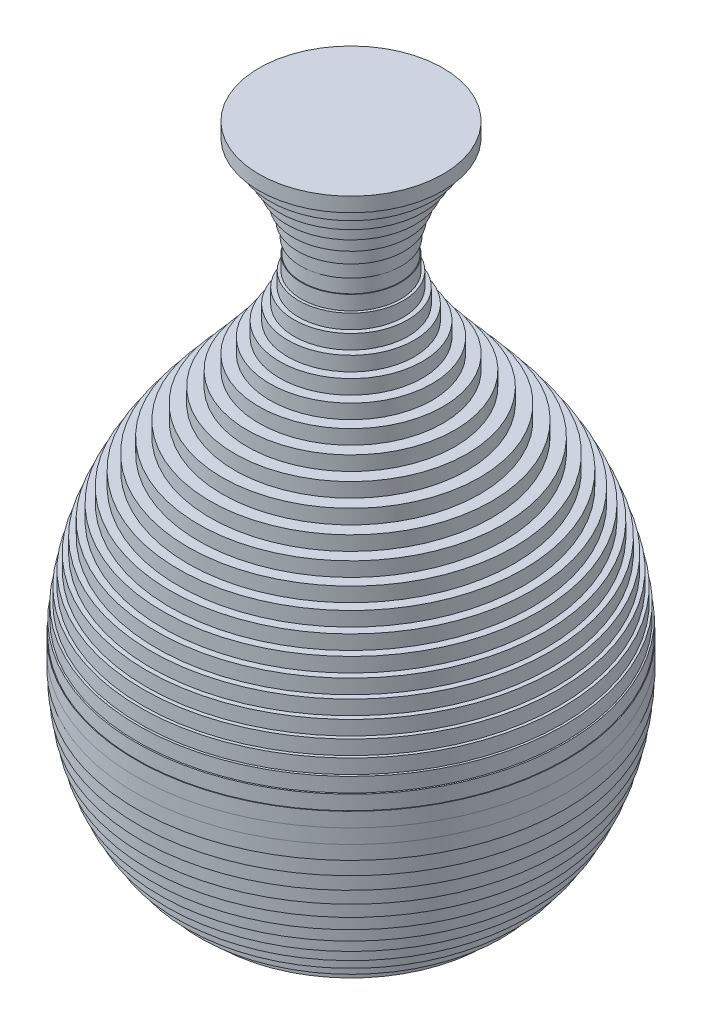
ISO-10303-21;
HEADER;
FILE_DESCRIPTION(('STEP AP214'),'2;1');
FILE_NAME('part.step','',(''),(''),'','','');
FILE_SCHEMA(('AUTOMOTIVE_DESIGN { 1 0 10303 214 1 1 1 1 }'));
ENDSEC;
DATA;
#1=APPLICATION_CONTEXT('core data for automotive mechanical design processes');
#2=APPLICATION_PROTOCOL_DEFINITION('international standard','automotive_design',2000,#1);
#3=PRODUCT_CONTEXT('',#1,'mechanical');
#4=PRODUCT('Part','Part','',(#3));
#5=PRODUCT_RELATED_PRODUCT_CATEGORY('part','',(#4));
#6=PRODUCT_DEFINITION_FORMATION('','',#4);
#7=PRODUCT_DEFINITION_CONTEXT('part definition',#1,'design');
#8=PRODUCT_DEFINITION('design','',#6,#7);
#9=PRODUCT_DEFINITION_SHAPE('','',#8);
#10=(LENGTH_UNIT() NAMED_UNIT(*) SI_UNIT(.MILLI.,.METRE.));
#11=(NAMED_UNIT(*) PLANE_ANGLE_UNIT() SI_UNIT($,.RADIAN.));
#12=(NAMED_UNIT(*) SI_UNIT($,.STERADIAN.) SOLID_ANGLE_UNIT());
#13=UNCERTAINTY_MEASURE_WITH_UNIT(LENGTH_MEASURE(1.E-05),#10,'distance_accuracy_value','');
#14=(GEOMETRIC_REPRESENTATION_CONTEXT(3) GLOBAL_UNCERTAINTY_ASSIGNED_CONTEXT((#13)) GLOBAL_UNIT_ASSIGNED_CONTEXT((#10,
#11,#12)) REPRESENTATION_CONTEXT('',''));
#15=CARTESIAN_POINT('',(0.,0.,0.));
#16=DIRECTION('',(0.,0.,1.));
#17=DIRECTION('',(1.,0.,0.));
#18=AXIS2_PLACEMENT_3D('',#15,#16,#17);
#19=CARTESIAN_POINT('',(-8.04911692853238E-13,225.,0.));
#20=DIRECTION('',(0.,1.,0.));
#21=DIRECTION('',(-1.,0.,0.));
#22=AXIS2_PLACEMENT_3D('',#19,#20,#21);
#23=PLANE('',#22);
#24=CARTESIAN_POINT('',(-8.04911692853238E-13,225.,0.));
#25=DIRECTION('',(0.,-1.,0.));
#26=DIRECTION('',(1.,0.,0.));
#27=AXIS2_PLACEMENT_3D('',#24,#25,#26);
#28=CIRCLE('',#27,32.);
#29=CARTESIAN_POINT('',(31.9999999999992,225.,0.));
#30=VERTEX_POINT('',#29);
#31=EDGE_CURVE('E10',#30,#30,#28,.T.);
#32=ORIENTED_EDGE('',*,*,#31,.F.);
#33=EDGE_LOOP('',(#32));
#34=FACE_BOUND('',#33,.T.);
#35=ADVANCED_FACE('F32',(#34),#23,.T.);
#36=CARTESIAN_POINT('',(0.,0.,0.));
#37=DIRECTION('',(0.,-1.,0.));
#38=DIRECTION('',(1.,0.,0.));
#39=AXIS2_PLACEMENT_3D('',#36,#37,#38);
#40=CYLINDRICAL_SURFACE('',#39,32.);
#41=ORIENTED_EDGE('',*,*,#31,.T.);
#42=EDGE_LOOP('',(#41));
#43=FACE_BOUND('',#42,.T.);
#44=CARTESIAN_POINT('',(-7.87641556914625E-13,220.,0.));
#45=DIRECTION('',(0.,-1.,0.));
#46=DIRECTION('',(1.,0.,0.));
#47=AXIS2_PLACEMENT_3D('',#44,#45,#46);
#48=CIRCLE('',#47,32.);
#49=CARTESIAN_POINT('',(31.9999999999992,220.,0.));
#50=VERTEX_POINT('',#49);
#51=EDGE_CURVE('E38',#50,#50,#48,.T.);
#52=ORIENTED_EDGE('',*,*,#51,.F.);
#53=EDGE_LOOP('',(#52));
#54=FACE_BOUND('',#53,.T.);
#55=ADVANCED_FACE('F326',(#43,#54),#40,.T.);
#56=CARTESIAN_POINT('',(31.9999999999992,220.,0.));
#57=DIRECTION('',(0.,-1.,0.));
#58=DIRECTION('',(1.,0.,0.));
#59=AXIS2_PLACEMENT_3D('',#56,#57,#58);
#60=PLANE('',#59);
#61=ORIENTED_EDGE('',*,*,#51,.T.);
#62=EDGE_LOOP('',(#61));
#63=FACE_BOUND('',#62,.T.);
#64=CARTESIAN_POINT('',(-7.87641556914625E-13,220.,0.));
#65=DIRECTION('',(0.,-1.,0.));
#66=DIRECTION('',(1.,0.,0.));
#67=AXIS2_PLACEMENT_3D('',#64,#65,#66);
#68=CIRCLE('',#67,28.3089987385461);
#69=CARTESIAN_POINT('',(28.3089987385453,220.,0.));
#70=VERTEX_POINT('',#69);
#71=EDGE_CURVE('E42',#70,#70,#68,.T.);
#72=ORIENTED_EDGE('',*,*,#71,.F.);
#73=EDGE_LOOP('',(#72));
#74=FACE_BOUND('',#73,.T.);
#75=ADVANCED_FACE('F331',(#63,#74),#60,.T.);
#76=CARTESIAN_POINT('',(0.,0.,0.));
#77=DIRECTION('',(0.,-1.,0.));
#78=DIRECTION('',(1.,0.,0.));
#79=AXIS2_PLACEMENT_3D('',#76,#77,#78);
#80=CYLINDRICAL_SURFACE('',#79,28.3089987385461);
#81=ORIENTED_EDGE('',*,*,#71,.T.);
#82=EDGE_LOOP('',(#81));
#83=FACE_BOUND('',#82,.T.);
#84=CARTESIAN_POINT('',(-7.70371420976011E-13,215.,0.));
#85=DIRECTION('',(0.,-1.,0.));
#86=DIRECTION('',(1.,0.,0.));
#87=AXIS2_PLACEMENT_3D('',#84,#85,#86);
#88=CIRCLE('',#87,28.3089987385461);
#89=CARTESIAN_POINT('',(28.3089987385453,215.,0.));
#90=VERTEX_POINT('',#89);
#91=EDGE_CURVE('E46',#90,#90,#88,.T.);
#92=ORIENTED_EDGE('',*,*,#91,.F.);
#93=EDGE_LOOP('',(#92));
#94=FACE_BOUND('',#93,.T.);
#95=ADVANCED_FACE('F335',(#83,#94),#80,.T.);
#96=CARTESIAN_POINT('',(28.3089987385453,215.,0.));
#97=DIRECTION('',(0.,-1.,0.));
#98=DIRECTION('',(1.,0.,0.));
#99=AXIS2_PLACEMENT_3D('',#96,#97,#98);
#100=PLANE('',#99);
#101=ORIENTED_EDGE('',*,*,#91,.T.);
#102=EDGE_LOOP('',(#101));
#103=FACE_BOUND('',#102,.T.);
#104=CARTESIAN_POINT('',(-7.70371420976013E-13,215.,0.));
#105=DIRECTION('',(0.,-1.,0.));
#106=DIRECTION('',(1.,0.,0.));
#107=AXIS2_PLACEMENT_3D('',#104,#105,#106);
#108=CIRCLE('',#107,25.0756866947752);
#109=CARTESIAN_POINT('',(25.0756866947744,215.,0.));
#110=VERTEX_POINT('',#109);
#111=EDGE_CURVE('E51',#110,#110,#108,.T.);
#112=ORIENTED_EDGE('',*,*,#111,.F.);
#113=EDGE_LOOP('',(#112));
#114=FACE_BOUND('',#113,.T.);
#115=ADVANCED_FACE('F341',(#103,#114),#100,.T.);
#116=CARTESIAN_POINT('',(0.,0.,0.));
#117=DIRECTION('',(0.,-1.,0.));
#118=DIRECTION('',(1.,0.,0.));
#119=AXIS2_PLACEMENT_3D('',#116,#117,#118);
#120=CYLINDRICAL_SURFACE('',#119,25.0756866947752);
#121=ORIENTED_EDGE('',*,*,#111,.T.);
#122=EDGE_LOOP('',(#121));
#123=FACE_BOUND('',#122,.T.);
#124=CARTESIAN_POINT('',(-7.53101285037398E-13,210.,0.));
#125=DIRECTION('',(0.,-1.,0.));
#126=DIRECTION('',(1.,0.,0.));
#127=AXIS2_PLACEMENT_3D('',#124,#125,#126);
#128=CIRCLE('',#127,25.0756866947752);
#129=CARTESIAN_POINT('',(25.0756866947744,210.,0.));
#130=VERTEX_POINT('',#129);
#131=EDGE_CURVE('E54',#130,#130,#128,.T.);
#132=ORIENTED_EDGE('',*,*,#131,.F.);
#133=EDGE_LOOP('',(#132));
#134=FACE_BOUND('',#133,.T.);
#135=ADVANCED_FACE('F345',(#123,#134),#120,.T.);
#136=CARTESIAN_POINT('',(25.0756866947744,210.000000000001,0.));
#137=DIRECTION('',(0.,-1.,0.));
#138=DIRECTION('',(1.,0.,0.));
#139=AXIS2_PLACEMENT_3D('',#136,#137,#138);
#140=PLANE('',#139);
#141=ORIENTED_EDGE('',*,*,#131,.T.);
#142=EDGE_LOOP('',(#141));
#143=FACE_BOUND('',#142,.T.);
#144=CARTESIAN_POINT('',(-7.53101285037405E-13,210.000000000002,0.));
#145=DIRECTION('',(0.,-1.,0.));
#146=DIRECTION('',(1.,0.,0.));
#147=AXIS2_PLACEMENT_3D('',#144,#145,#146);
#148=CIRCLE('',#147,22.3349579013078);
#149=CARTESIAN_POINT('',(22.3349579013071,210.000000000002,0.));
#150=VERTEX_POINT('',#149);
#151=EDGE_CURVE('E57',#150,#150,#148,.T.);
#152=ORIENTED_EDGE('',*,*,#151,.F.);
#153=EDGE_LOOP('',(#152));
#154=FACE_BOUND('',#153,.T.);
#155=ADVANCED_FACE('F349',(#143,#154),#140,.T.);
#156=CARTESIAN_POINT('',(0.,0.,0.));
#157=DIRECTION('',(0.,-1.,0.));
#158=DIRECTION('',(1.,0.,0.));
#159=AXIS2_PLACEMENT_3D('',#156,#157,#158);
#160=CYLINDRICAL_SURFACE('',#159,22.3349579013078);
#161=ORIENTED_EDGE('',*,*,#151,.T.);
#162=EDGE_LOOP('',(#161));
#163=FACE_BOUND('',#162,.T.);
#164=CARTESIAN_POINT('',(-7.35831149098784E-13,205.,0.));
#165=DIRECTION('',(0.,-1.,0.));
#166=DIRECTION('',(1.,0.,0.));
#167=AXIS2_PLACEMENT_3D('',#164,#165,#166);
#168=CIRCLE('',#167,22.3349579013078);
#169=CARTESIAN_POINT('',(22.3349579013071,205.,0.));
#170=VERTEX_POINT('',#169);
#171=EDGE_CURVE('E60',#170,#170,#168,.T.);
#172=ORIENTED_EDGE('',*,*,#171,.F.);
#173=EDGE_LOOP('',(#172));
#174=FACE_BOUND('',#173,.T.);
#175=ADVANCED_FACE('F353',(#163,#174),#160,.T.);
#176=CARTESIAN_POINT('',(22.3349579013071,205.,0.));
#177=DIRECTION('',(0.,-1.,0.));
#178=DIRECTION('',(1.,0.,0.));
#179=AXIS2_PLACEMENT_3D('',#176,#177,#178);
#180=PLANE('',#179);
#181=ORIENTED_EDGE('',*,*,#171,.T.);
#182=EDGE_LOOP('',(#181));
#183=FACE_BOUND('',#182,.T.);
#184=CARTESIAN_POINT('',(-7.35831149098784E-13,205.,0.));
#185=DIRECTION('',(0.,-1.,0.));
#186=DIRECTION('',(1.,0.,0.));
#187=AXIS2_PLACEMENT_3D('',#184,#185,#186);
#188=CIRCLE('',#187,20.1229760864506);
#189=CARTESIAN_POINT('',(20.1229760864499,205.,0.));
#190=VERTEX_POINT('',#189);
#191=EDGE_CURVE('E63',#190,#190,#188,.T.);
#192=ORIENTED_EDGE('',*,*,#191,.F.);
#193=EDGE_LOOP('',(#192));
#194=FACE_BOUND('',#193,.T.);
#195=ADVANCED_FACE('F357',(#183,#194),#180,.T.);
#196=CARTESIAN_POINT('',(0.,0.,0.));
#197=DIRECTION('',(0.,-1.,0.));
#198=DIRECTION('',(1.,0.,0.));
#199=AXIS2_PLACEMENT_3D('',#196,#197,#198);
#200=CYLINDRICAL_SURFACE('',#199,20.1229760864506);
#201=ORIENTED_EDGE('',*,*,#191,.T.);
#202=EDGE_LOOP('',(#201));
#203=FACE_BOUND('',#202,.T.);
#204=CARTESIAN_POINT('',(-7.18561013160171E-13,200.,0.));
#205=DIRECTION('',(0.,-1.,0.));
#206=DIRECTION('',(1.,0.,0.));
#207=AXIS2_PLACEMENT_3D('',#204,#205,#206);
#208=CIRCLE('',#207,20.1229760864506);
#209=CARTESIAN_POINT('',(20.1229760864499,200.,0.));
#210=VERTEX_POINT('',#209);
#211=EDGE_CURVE('E66',#210,#210,#208,.T.);
#212=ORIENTED_EDGE('',*,*,#211,.F.);
#213=EDGE_LOOP('',(#212));
#214=FACE_BOUND('',#213,.T.);
#215=ADVANCED_FACE('F361',(#203,#214),#200,.T.);
#216=CARTESIAN_POINT('',(20.1229760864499,200.,0.));
#217=DIRECTION('',(0.,-1.,0.));
#218=DIRECTION('',(1.,0.,0.));
#219=AXIS2_PLACEMENT_3D('',#216,#217,#218);
#220=PLANE('',#219);
#221=ORIENTED_EDGE('',*,*,#211,.T.);
#222=EDGE_LOOP('',(#221));
#223=FACE_BOUND('',#222,.T.);
#224=CARTESIAN_POINT('',(-7.18561013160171E-13,200.,0.));
#225=DIRECTION('',(0.,-1.,0.));
#226=DIRECTION('',(1.,0.,0.));
#227=AXIS2_PLACEMENT_3D('',#224,#225,#226);
#228=CIRCLE('',#227,18.4761972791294);
#229=CARTESIAN_POINT('',(18.4761972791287,200.,0.));
#230=VERTEX_POINT('',#229);
#231=EDGE_CURVE('E69',#230,#230,#228,.T.);
#232=ORIENTED_EDGE('',*,*,#231,.F.);
#233=EDGE_LOOP('',(#232));
#234=FACE_BOUND('',#233,.T.);
#235=ADVANCED_FACE('F365',(#223,#234),#220,.T.);
#236=CARTESIAN_POINT('',(0.,0.,0.));
#237=DIRECTION('',(0.,-1.,0.));
#238=DIRECTION('',(1.,0.,0.));
#239=AXIS2_PLACEMENT_3D('',#236,#237,#238);
#240=CYLINDRICAL_SURFACE('',#239,18.4761972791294);
#241=ORIENTED_EDGE('',*,*,#231,.T.);
#242=EDGE_LOOP('',(#241));
#243=FACE_BOUND('',#242,.T.);
#244=CARTESIAN_POINT('',(-7.01290877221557E-13,195.,0.));
#245=DIRECTION('',(0.,-1.,0.));
#246=DIRECTION('',(1.,0.,0.));
#247=AXIS2_PLACEMENT_3D('',#244,#245,#246);
#248=CIRCLE('',#247,18.4761972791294);
#249=CARTESIAN_POINT('',(18.4761972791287,195.,0.));
#250=VERTEX_POINT('',#249);
#251=EDGE_CURVE('E72',#250,#250,#248,.T.);
#252=ORIENTED_EDGE('',*,*,#251,.F.);
#253=EDGE_LOOP('',(#252));
#254=FACE_BOUND('',#253,.T.);
#255=ADVANCED_FACE('F369',(#243,#254),#240,.T.);
#256=CARTESIAN_POINT('',(18.4761972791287,195.,0.));
#257=DIRECTION('',(0.,-1.,0.));
#258=DIRECTION('',(1.,0.,0.));
#259=AXIS2_PLACEMENT_3D('',#256,#257,#258);
#260=PLANE('',#259);
#261=ORIENTED_EDGE('',*,*,#251,.T.);
#262=EDGE_LOOP('',(#261));
#263=FACE_BOUND('',#262,.T.);
#264=CARTESIAN_POINT('',(-7.01290877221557E-13,195.,0.));
#265=DIRECTION('',(0.,-1.,0.));
#266=DIRECTION('',(1.,0.,0.));
#267=AXIS2_PLACEMENT_3D('',#264,#265,#266);
#268=CIRCLE('',#267,17.4298489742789);
#269=CARTESIAN_POINT('',(17.4298489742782,195.,0.));
#270=VERTEX_POINT('',#269);
#271=EDGE_CURVE('E75',#270,#270,#268,.T.);
#272=ORIENTED_EDGE('',*,*,#271,.F.);
#273=EDGE_LOOP('',(#272));
#274=FACE_BOUND('',#273,.T.);
#275=ADVANCED_FACE('F373',(#263,#274),#260,.T.);
#276=CARTESIAN_POINT('',(0.,0.,0.));
#277=DIRECTION('',(0.,-1.,0.));
#278=DIRECTION('',(1.,0.,0.));
#279=AXIS2_PLACEMENT_3D('',#276,#277,#278);
#280=CYLINDRICAL_SURFACE('',#279,17.4298489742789);
#281=ORIENTED_EDGE('',*,*,#271,.T.);
#282=EDGE_LOOP('',(#281));
#283=FACE_BOUND('',#282,.T.);
#284=CARTESIAN_POINT('',(-6.84020741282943E-13,190.,0.));
#285=DIRECTION('',(0.,-1.,0.));
#286=DIRECTION('',(1.,0.,0.));
#287=AXIS2_PLACEMENT_3D('',#284,#285,#286);
#288=CIRCLE('',#287,17.4298489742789);
#289=CARTESIAN_POINT('',(17.4298489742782,190.,0.));
#290=VERTEX_POINT('',#289);
#291=EDGE_CURVE('E78',#290,#290,#288,.T.);
#292=ORIENTED_EDGE('',*,*,#291,.F.);
#293=EDGE_LOOP('',(#292));
#294=FACE_BOUND('',#293,.T.);
#295=ADVANCED_FACE('F377',(#283,#294),#280,.T.);
#296=CARTESIAN_POINT('',(17.4298489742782,190.,0.));
#297=DIRECTION('',(0.,-1.,0.));
#298=DIRECTION('',(1.,0.,0.));
#299=AXIS2_PLACEMENT_3D('',#296,#297,#298);
#300=PLANE('',#299);
#301=ORIENTED_EDGE('',*,*,#291,.T.);
#302=EDGE_LOOP('',(#301));
#303=FACE_BOUND('',#302,.T.);
#304=CARTESIAN_POINT('',(-6.84020741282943E-13,190.,0.));
#305=DIRECTION('',(0.,-1.,0.));
#306=DIRECTION('',(1.,0.,0.));
#307=AXIS2_PLACEMENT_3D('',#304,#305,#306);
#308=CIRCLE('',#307,17.0157053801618);
#309=CARTESIAN_POINT('',(17.0157053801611,190.,0.));
#310=VERTEX_POINT('',#309);
#311=EDGE_CURVE('E81',#310,#310,#308,.T.);
#312=ORIENTED_EDGE('',*,*,#311,.F.);
#313=EDGE_LOOP('',(#312));
#314=FACE_BOUND('',#313,.T.);
#315=ADVANCED_FACE('F381',(#303,#314),#300,.T.);
#316=CARTESIAN_POINT('',(0.,0.,0.));
#317=DIRECTION('',(0.,-1.,0.));
#318=DIRECTION('',(1.,0.,0.));
#319=AXIS2_PLACEMENT_3D('',#316,#317,#318);
#320=CYLINDRICAL_SURFACE('',#319,17.0157053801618);
#321=ORIENTED_EDGE('',*,*,#311,.T.);
#322=EDGE_LOOP('',(#321));
#323=FACE_BOUND('',#322,.T.);
#324=CARTESIAN_POINT('',(-6.6675060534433E-13,185.,0.));
#325=DIRECTION('',(0.,-1.,0.));
#326=DIRECTION('',(1.,0.,0.));
#327=AXIS2_PLACEMENT_3D('',#324,#325,#326);
#328=CIRCLE('',#327,17.0157053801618);
#329=CARTESIAN_POINT('',(17.0157053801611,185.,0.));
#330=VERTEX_POINT('',#329);
#331=EDGE_CURVE('E84',#330,#330,#328,.T.);
#332=ORIENTED_EDGE('',*,*,#331,.F.);
#333=EDGE_LOOP('',(#332));
#334=FACE_BOUND('',#333,.T.);
#335=ADVANCED_FACE('F385',(#323,#334),#320,.T.);
#336=CARTESIAN_POINT('',(17.0157053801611,185.,0.));
#337=DIRECTION('',(0.,1.,0.));
#338=DIRECTION('',(-1.,0.,0.));
#339=AXIS2_PLACEMENT_3D('',#336,#337,#338);
#340=PLANE('',#339);
#341=ORIENTED_EDGE('',*,*,#331,.T.);
#342=EDGE_LOOP('',(#341));
#343=FACE_BOUND('',#342,.T.);
#344=CARTESIAN_POINT('',(-6.6675060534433E-13,185.,0.));
#345=DIRECTION('',(0.,-1.,0.));
#346=DIRECTION('',(1.,0.,0.));
#347=AXIS2_PLACEMENT_3D('',#344,#345,#346);
#348=CIRCLE('',#347,17.2590173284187);
#349=CARTESIAN_POINT('',(17.2590173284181,185.,0.));
#350=VERTEX_POINT('',#349);
#351=EDGE_CURVE('E87',#350,#350,#348,.T.);
#352=ORIENTED_EDGE('',*,*,#351,.F.);
#353=EDGE_LOOP('',(#352));
#354=FACE_BOUND('',#353,.T.);
#355=ADVANCED_FACE('F389',(#343,#354),#340,.T.);
#356=CARTESIAN_POINT('',(0.,0.,0.));
#357=DIRECTION('',(0.,-1.,0.));
#358=DIRECTION('',(1.,0.,0.));
#359=AXIS2_PLACEMENT_3D('',#356,#357,#358);
#360=CYLINDRICAL_SURFACE('',#359,17.2590173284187);
#361=ORIENTED_EDGE('',*,*,#351,.T.);
#362=EDGE_LOOP('',(#361));
#363=FACE_BOUND('',#362,.T.);
#364=CARTESIAN_POINT('',(-6.49480469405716E-13,180.,0.));
#365=DIRECTION('',(0.,-1.,0.));
#366=DIRECTION('',(1.,0.,0.));
#367=AXIS2_PLACEMENT_3D('',#364,#365,#366);
#368=CIRCLE('',#367,17.2590173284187);
#369=CARTESIAN_POINT('',(17.2590173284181,180.,0.));
#370=VERTEX_POINT('',#369);
#371=EDGE_CURVE('E90',#370,#370,#368,.T.);
#372=ORIENTED_EDGE('',*,*,#371,.F.);
#373=EDGE_LOOP('',(#372));
#374=FACE_BOUND('',#373,.T.);
#375=ADVANCED_FACE('F393',(#363,#374),#360,.T.);
#376=CARTESIAN_POINT('',(17.2590173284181,180.,0.));
#377=DIRECTION('',(0.,1.,0.));
#378=DIRECTION('',(-1.,0.,0.));
#379=AXIS2_PLACEMENT_3D('',#376,#377,#378);
#380=PLANE('',#379);
#381=ORIENTED_EDGE('',*,*,#371,.T.);
#382=EDGE_LOOP('',(#381));
#383=FACE_BOUND('',#382,.T.);
#384=CARTESIAN_POINT('',(-6.49480469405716E-13,180.,0.));
#385=DIRECTION('',(0.,-1.,0.));
#386=DIRECTION('',(1.,0.,0.));
#387=AXIS2_PLACEMENT_3D('',#384,#385,#386);
#388=CIRCLE('',#387,18.1745402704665);
#389=CARTESIAN_POINT('',(18.1745402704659,180.,0.));
#390=VERTEX_POINT('',#389);
#391=EDGE_CURVE('E93',#390,#390,#388,.T.);
#392=ORIENTED_EDGE('',*,*,#391,.F.);
#393=EDGE_LOOP('',(#392));
#394=FACE_BOUND('',#393,.T.);
#395=ADVANCED_FACE('F397',(#383,#394),#380,.T.);
#396=CARTESIAN_POINT('',(0.,0.,0.));
#397=DIRECTION('',(0.,-1.,0.));
#398=DIRECTION('',(1.,0.,0.));
#399=AXIS2_PLACEMENT_3D('',#396,#397,#398);
#400=CYLINDRICAL_SURFACE('',#399,18.1745402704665);
#401=ORIENTED_EDGE('',*,*,#391,.T.);
#402=EDGE_LOOP('',(#401));
#403=FACE_BOUND('',#402,.T.);
#404=CARTESIAN_POINT('',(-6.32210333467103E-13,175.,0.));
#405=DIRECTION('',(0.,-1.,0.));
#406=DIRECTION('',(1.,0.,0.));
#407=AXIS2_PLACEMENT_3D('',#404,#405,#406);
#408=CIRCLE('',#407,18.1745402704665);
#409=CARTESIAN_POINT('',(18.1745402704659,175.,0.));
#410=VERTEX_POINT('',#409);
#411=EDGE_CURVE('E96',#410,#410,#408,.T.);
#412=ORIENTED_EDGE('',*,*,#411,.F.);
#413=EDGE_LOOP('',(#412));
#414=FACE_BOUND('',#413,.T.);
#415=ADVANCED_FACE('F401',(#403,#414),#400,.T.);
#416=CARTESIAN_POINT('',(18.1745402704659,175.,0.));
#417=DIRECTION('',(0.,1.,0.));
#418=DIRECTION('',(-1.,0.,0.));
#419=AXIS2_PLACEMENT_3D('',#416,#417,#418);
#420=PLANE('',#419);
#421=ORIENTED_EDGE('',*,*,#411,.T.);
#422=EDGE_LOOP('',(#421));
#423=FACE_BOUND('',#422,.T.);
#424=CARTESIAN_POINT('',(-6.32210333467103E-13,175.,0.));
#425=DIRECTION('',(0.,-1.,0.));
#426=DIRECTION('',(1.,0.,0.));
#427=AXIS2_PLACEMENT_3D('',#424,#425,#426);
#428=CIRCLE('',#427,19.7617931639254);
#429=CARTESIAN_POINT('',(19.7617931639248,175.,0.));
#430=VERTEX_POINT('',#429);
#431=EDGE_CURVE('E99',#430,#430,#428,.T.);
#432=ORIENTED_EDGE('',*,*,#431,.F.);
#433=EDGE_LOOP('',(#432));
#434=FACE_BOUND('',#433,.T.);
#435=ADVANCED_FACE('F405',(#423,#434),#420,.T.);
#436=CARTESIAN_POINT('',(0.,0.,0.));
#437=DIRECTION('',(0.,-1.,0.));
#438=DIRECTION('',(1.,0.,0.));
#439=AXIS2_PLACEMENT_3D('',#436,#437,#438);
#440=CYLINDRICAL_SURFACE('',#439,19.7617931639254);
#441=ORIENTED_EDGE('',*,*,#431,.T.);
#442=EDGE_LOOP('',(#441));
#443=FACE_BOUND('',#442,.T.);
#444=CARTESIAN_POINT('',(-6.14940197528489E-13,170.,0.));
#445=DIRECTION('',(0.,-1.,0.));
#446=DIRECTION('',(1.,0.,0.));
#447=AXIS2_PLACEMENT_3D('',#444,#445,#446);
#448=CIRCLE('',#447,19.7617931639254);
#449=CARTESIAN_POINT('',(19.7617931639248,170.,0.));
#450=VERTEX_POINT('',#449);
#451=EDGE_CURVE('E102',#450,#450,#448,.T.);
#452=ORIENTED_EDGE('',*,*,#451,.F.);
#453=EDGE_LOOP('',(#452));
#454=FACE_BOUND('',#453,.T.);
#455=ADVANCED_FACE('F409',(#443,#454),#440,.T.);
#456=CARTESIAN_POINT('',(19.7617931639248,170.,0.));
#457=DIRECTION('',(0.,1.,0.));
#458=DIRECTION('',(-1.,0.,0.));
#459=AXIS2_PLACEMENT_3D('',#456,#457,#458);
#460=PLANE('',#459);
#461=ORIENTED_EDGE('',*,*,#451,.T.);
#462=EDGE_LOOP('',(#461));
#463=FACE_BOUND('',#462,.T.);
#464=CARTESIAN_POINT('',(-6.14940197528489E-13,170.,0.));
#465=DIRECTION('',(0.,-1.,0.));
#466=DIRECTION('',(1.,0.,0.));
#467=AXIS2_PLACEMENT_3D('',#464,#465,#466);
#468=CIRCLE('',#467,22.0000000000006);
#469=CARTESIAN_POINT('',(22.,170.,0.));
#470=VERTEX_POINT('',#469);
#471=EDGE_CURVE('E105',#470,#470,#468,.T.);
#472=ORIENTED_EDGE('',*,*,#471,.F.);
#473=EDGE_LOOP('',(#472));
#474=FACE_BOUND('',#473,.T.);
#475=ADVANCED_FACE('F413',(#463,#474),#460,.T.);
#476=CARTESIAN_POINT('',(0.,0.,0.));
#477=DIRECTION('',(0.,-1.,0.));
#478=DIRECTION('',(1.,0.,0.));
#479=AXIS2_PLACEMENT_3D('',#476,#477,#478);
#480=CYLINDRICAL_SURFACE('',#479,22.0000000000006);
#481=ORIENTED_EDGE('',*,*,#471,.T.);
#482=EDGE_LOOP('',(#481));
#483=FACE_BOUND('',#482,.T.);
#484=CARTESIAN_POINT('',(-5.97670061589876E-13,165.,0.));
#485=DIRECTION('',(0.,-1.,0.));
#486=DIRECTION('',(1.,0.,0.));
#487=AXIS2_PLACEMENT_3D('',#484,#485,#486);
#488=CIRCLE('',#487,22.0000000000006);
#489=CARTESIAN_POINT('',(22.,165.,0.));
#490=VERTEX_POINT('',#489);
#491=EDGE_CURVE('E108',#490,#490,#488,.T.);
#492=ORIENTED_EDGE('',*,*,#491,.F.);
#493=EDGE_LOOP('',(#492));
#494=FACE_BOUND('',#493,.T.);
#495=ADVANCED_FACE('F417',(#483,#494),#480,.T.);
#496=CARTESIAN_POINT('',(22.,165.,0.));
#497=DIRECTION('',(0.,1.,0.));
#498=DIRECTION('',(-1.,0.,0.));
#499=AXIS2_PLACEMENT_3D('',#496,#497,#498);
#500=PLANE('',#499);
#501=ORIENTED_EDGE('',*,*,#491,.T.);
#502=EDGE_LOOP('',(#501));
#503=FACE_BOUND('',#502,.T.);
#504=CARTESIAN_POINT('',(-5.97670061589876E-13,165.,0.));
#505=DIRECTION('',(0.,-1.,0.));
#506=DIRECTION('',(1.,0.,0.));
#507=AXIS2_PLACEMENT_3D('',#504,#505,#506);
#508=CIRCLE('',#507,24.8435841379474);
#509=CARTESIAN_POINT('',(24.8435841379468,165.,0.));
#510=VERTEX_POINT('',#509);
#511=EDGE_CURVE('E111',#510,#510,#508,.T.);
#512=ORIENTED_EDGE('',*,*,#511,.F.);
#513=EDGE_LOOP('',(#512));
#514=FACE_BOUND('',#513,.T.);
#515=ADVANCED_FACE('F421',(#503,#514),#500,.T.);
#516=CARTESIAN_POINT('',(0.,0.,0.));
#517=DIRECTION('',(0.,-1.,0.));
#518=DIRECTION('',(1.,0.,0.));
#519=AXIS2_PLACEMENT_3D('',#516,#517,#518);
#520=CYLINDRICAL_SURFACE('',#519,24.8435841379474);
#521=ORIENTED_EDGE('',*,*,#511,.T.);
#522=EDGE_LOOP('',(#521));
#523=FACE_BOUND('',#522,.T.);
#524=CARTESIAN_POINT('',(-5.80399925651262E-13,160.,0.));
#525=DIRECTION('',(0.,-1.,0.));
#526=DIRECTION('',(1.,0.,0.));
#527=AXIS2_PLACEMENT_3D('',#524,#525,#526);
#528=CIRCLE('',#527,24.8435841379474);
#529=CARTESIAN_POINT('',(24.8435841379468,160.,0.));
#530=VERTEX_POINT('',#529);
#531=EDGE_CURVE('E114',#530,#530,#528,.T.);
#532=ORIENTED_EDGE('',*,*,#531,.F.);
#533=EDGE_LOOP('',(#532));
#534=FACE_BOUND('',#533,.T.);
#535=ADVANCED_FACE('F425',(#523,#534),#520,.T.);
#536=CARTESIAN_POINT('',(24.8435841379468,160.,0.));
#537=DIRECTION('',(0.,1.,0.));
#538=DIRECTION('',(-1.,0.,0.));
#539=AXIS2_PLACEMENT_3D('',#536,#537,#538);
#540=PLANE('',#539);
#541=ORIENTED_EDGE('',*,*,#531,.T.);
#542=EDGE_LOOP('',(#541));
#543=FACE_BOUND('',#542,.T.);
#544=CARTESIAN_POINT('',(-5.80399925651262E-13,160.,0.));
#545=DIRECTION('',(0.,-1.,0.));
#546=DIRECTION('',(1.,0.,0.));
#547=AXIS2_PLACEMENT_3D('',#544,#545,#546);
#548=CIRCLE('',#547,28.2194677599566);
#549=CARTESIAN_POINT('',(28.219467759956,160.,0.));
#550=VERTEX_POINT('',#549);
#551=EDGE_CURVE('E117',#550,#550,#548,.T.);
#552=ORIENTED_EDGE('',*,*,#551,.F.);
#553=EDGE_LOOP('',(#552));
#554=FACE_BOUND('',#553,.T.);
#555=ADVANCED_FACE('F429',(#543,#554),#540,.T.);
#556=CARTESIAN_POINT('',(0.,0.,0.));
#557=DIRECTION('',(0.,-1.,0.));
#558=DIRECTION('',(1.,0.,0.));
#559=AXIS2_PLACEMENT_3D('',#556,#557,#558);
#560=CYLINDRICAL_SURFACE('',#559,28.2194677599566);
#561=ORIENTED_EDGE('',*,*,#551,.T.);
#562=EDGE_LOOP('',(#561));
#563=FACE_BOUND('',#562,.T.);
#564=CARTESIAN_POINT('',(-5.63129789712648E-13,155.,0.));
#565=DIRECTION('',(0.,-1.,0.));
#566=DIRECTION('',(1.,0.,0.));
#567=AXIS2_PLACEMENT_3D('',#564,#565,#566);
#568=CIRCLE('',#567,28.2194677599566);
#569=CARTESIAN_POINT('',(28.219467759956,155.,0.));
#570=VERTEX_POINT('',#569);
#571=EDGE_CURVE('E120',#570,#570,#568,.T.);
#572=ORIENTED_EDGE('',*,*,#571,.F.);
#573=EDGE_LOOP('',(#572));
#574=FACE_BOUND('',#573,.T.);
#575=ADVANCED_FACE('F433',(#563,#574),#560,.T.);
#576=CARTESIAN_POINT('',(28.219467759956,155.,0.));
#577=DIRECTION('',(0.,1.,0.));
#578=DIRECTION('',(-1.,0.,0.));
#579=AXIS2_PLACEMENT_3D('',#576,#577,#578);
#580=PLANE('',#579);
#581=ORIENTED_EDGE('',*,*,#571,.T.);
#582=EDGE_LOOP('',(#581));
#583=FACE_BOUND('',#582,.T.);
#584=CARTESIAN_POINT('',(-5.63129789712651E-13,155.,0.));
#585=DIRECTION('',(0.,-1.,0.));
#586=DIRECTION('',(1.,0.,0.));
#587=AXIS2_PLACEMENT_3D('',#584,#585,#586);
#588=CIRCLE('',#587,32.0275234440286);
#589=CARTESIAN_POINT('',(32.027523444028,155.000000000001,0.));
#590=VERTEX_POINT('',#589);
#591=EDGE_CURVE('E123',#590,#590,#588,.T.);
#592=ORIENTED_EDGE('',*,*,#591,.F.);
#593=EDGE_LOOP('',(#592));
#594=FACE_BOUND('',#593,.T.);
#595=ADVANCED_FACE('F437',(#583,#594),#580,.T.);
#596=CARTESIAN_POINT('',(0.,0.,0.));
#597=DIRECTION('',(0.,-1.,0.));
#598=DIRECTION('',(1.,0.,0.));
#599=AXIS2_PLACEMENT_3D('',#596,#597,#598);
#600=CYLINDRICAL_SURFACE('',#599,32.0275234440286);
#601=ORIENTED_EDGE('',*,*,#591,.T.);
#602=EDGE_LOOP('',(#601));
#603=FACE_BOUND('',#602,.T.);
#604=CARTESIAN_POINT('',(-5.45859653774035E-13,150.,0.));
#605=DIRECTION('',(0.,-1.,0.));
#606=DIRECTION('',(1.,0.,0.));
#607=AXIS2_PLACEMENT_3D('',#604,#605,#606);
#608=CIRCLE('',#607,32.0275234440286);
#609=CARTESIAN_POINT('',(32.027523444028,150.,0.));
#610=VERTEX_POINT('',#609);
#611=EDGE_CURVE('E126',#610,#610,#608,.T.);
#612=ORIENTED_EDGE('',*,*,#611,.F.);
#613=EDGE_LOOP('',(#612));
#614=FACE_BOUND('',#613,.T.);
#615=ADVANCED_FACE('F441',(#603,#614),#600,.T.);
#616=CARTESIAN_POINT('',(32.027523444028,150.,0.));
#617=DIRECTION('',(0.,1.,0.));
#618=DIRECTION('',(-1.,0.,0.));
#619=AXIS2_PLACEMENT_3D('',#616,#617,#618);
#620=PLANE('',#619);
#621=ORIENTED_EDGE('',*,*,#611,.T.);
#622=EDGE_LOOP('',(#621));
#623=FACE_BOUND('',#622,.T.);
#624=CARTESIAN_POINT('',(-5.45859653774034E-13,150.,0.));
#625=DIRECTION('',(0.,-1.,0.));
#626=DIRECTION('',(1.,0.,0.));
#627=AXIS2_PLACEMENT_3D('',#624,#625,#626);
#628=CIRCLE('',#627,36.1450703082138);
#629=CARTESIAN_POINT('',(36.1450703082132,150.,0.));
#630=VERTEX_POINT('',#629);
#631=EDGE_CURVE('E129',#630,#630,#628,.T.);
#632=ORIENTED_EDGE('',*,*,#631,.F.);
#633=EDGE_LOOP('',(#632));
#634=FACE_BOUND('',#633,.T.);
#635=ADVANCED_FACE('F445',(#623,#634),#620,.T.);
#636=CARTESIAN_POINT('',(0.,0.,0.));
#637=DIRECTION('',(0.,-1.,0.));
#638=DIRECTION('',(1.,0.,0.));
#639=AXIS2_PLACEMENT_3D('',#636,#637,#638);
#640=CYLINDRICAL_SURFACE('',#639,36.1450703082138);
#641=ORIENTED_EDGE('',*,*,#631,.T.);
#642=EDGE_LOOP('',(#641));
#643=FACE_BOUND('',#642,.T.);
#644=CARTESIAN_POINT('',(-5.28589517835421E-13,145.,0.));
#645=DIRECTION('',(0.,-1.,0.));
#646=DIRECTION('',(1.,0.,0.));
#647=AXIS2_PLACEMENT_3D('',#644,#645,#646);
#648=CIRCLE('',#647,36.1450703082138);
#649=CARTESIAN_POINT('',(36.1450703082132,145.,0.));
#650=VERTEX_POINT('',#649);
#651=EDGE_CURVE('E132',#650,#650,#648,.T.);
#652=ORIENTED_EDGE('',*,*,#651,.F.);
#653=EDGE_LOOP('',(#652));
#654=FACE_BOUND('',#653,.T.);
#655=ADVANCED_FACE('F449',(#643,#654),#640,.T.);
#656=CARTESIAN_POINT('',(36.1450703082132,145.,0.));
#657=DIRECTION('',(0.,1.,0.));
#658=DIRECTION('',(-1.,0.,0.));
#659=AXIS2_PLACEMENT_3D('',#656,#657,#658);
#660=PLANE('',#659);
#661=ORIENTED_EDGE('',*,*,#651,.T.);
#662=EDGE_LOOP('',(#661));
#663=FACE_BOUND('',#662,.T.);
#664=CARTESIAN_POINT('',(-5.28589517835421E-13,145.,0.));
#665=DIRECTION('',(0.,-1.,0.));
#666=DIRECTION('',(1.,0.,0.));
#667=AXIS2_PLACEMENT_3D('',#664,#665,#666);
#668=CIRCLE('',#667,40.4352595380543);
#669=CARTESIAN_POINT('',(40.4352595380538,145.,0.));
#670=VERTEX_POINT('',#669);
#671=EDGE_CURVE('E135',#670,#670,#668,.T.);
#672=ORIENTED_EDGE('',*,*,#671,.F.);
#673=EDGE_LOOP('',(#672));
#674=FACE_BOUND('',#673,.T.);
#675=ADVANCED_FACE('F453',(#663,#674),#660,.T.);
#676=CARTESIAN_POINT('',(0.,0.,0.));
#677=DIRECTION('',(0.,-1.,0.));
#678=DIRECTION('',(1.,0.,0.));
#679=AXIS2_PLACEMENT_3D('',#676,#677,#678);
#680=CYLINDRICAL_SURFACE('',#679,40.4352595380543);
#681=ORIENTED_EDGE('',*,*,#671,.T.);
#682=EDGE_LOOP('',(#681));
#683=FACE_BOUND('',#682,.T.);
#684=CARTESIAN_POINT('',(-5.11319381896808E-13,140.,0.));
#685=DIRECTION('',(0.,-1.,0.));
#686=DIRECTION('',(1.,0.,0.));
#687=AXIS2_PLACEMENT_3D('',#684,#685,#686);
#688=CIRCLE('',#687,40.4352595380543);
#689=CARTESIAN_POINT('',(40.4352595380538,140.,0.));
#690=VERTEX_POINT('',#689);
#691=EDGE_CURVE('E138',#690,#690,#688,.T.);
#692=ORIENTED_EDGE('',*,*,#691,.F.);
#693=EDGE_LOOP('',(#692));
#694=FACE_BOUND('',#693,.T.);
#695=ADVANCED_FACE('F457',(#683,#694),#680,.T.);
#696=CARTESIAN_POINT('',(40.4352595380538,140.,0.));
#697=DIRECTION('',(0.,1.,0.));
#698=DIRECTION('',(-1.,0.,0.));
#699=AXIS2_PLACEMENT_3D('',#696,#697,#698);
#700=PLANE('',#699);
#701=ORIENTED_EDGE('',*,*,#691,.T.);
#702=EDGE_LOOP('',(#701));
#703=FACE_BOUND('',#702,.T.);
#704=CARTESIAN_POINT('',(-5.11319381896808E-13,140.,0.));
#705=DIRECTION('',(0.,-1.,0.));
#706=DIRECTION('',(1.,0.,0.));
#707=AXIS2_PLACEMENT_3D('',#704,#705,#706);
#708=CIRCLE('',#707,44.7579139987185);
#709=CARTESIAN_POINT('',(44.757913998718,140.,0.));
#710=VERTEX_POINT('',#709);
#711=EDGE_CURVE('E141',#710,#710,#708,.T.);
#712=ORIENTED_EDGE('',*,*,#711,.F.);
#713=EDGE_LOOP('',(#712));
#714=FACE_BOUND('',#713,.T.);
#715=ADVANCED_FACE('F461',(#703,#714),#700,.T.);
#716=CARTESIAN_POINT('',(0.,0.,0.));
#717=DIRECTION('',(0.,-1.,0.));
#718=DIRECTION('',(1.,0.,0.));
#719=AXIS2_PLACEMENT_3D('',#716,#717,#718);
#720=CYLINDRICAL_SURFACE('',#719,44.7579139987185);
#721=ORIENTED_EDGE('',*,*,#711,.T.);
#722=EDGE_LOOP('',(#721));
#723=FACE_BOUND('',#722,.T.);
#724=CARTESIAN_POINT('',(-4.94049245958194E-13,135.,0.));
#725=DIRECTION('',(0.,-1.,0.));
#726=DIRECTION('',(1.,0.,0.));
#727=AXIS2_PLACEMENT_3D('',#724,#725,#726);
#728=CIRCLE('',#727,44.7579139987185);
#729=CARTESIAN_POINT('',(44.757913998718,135.,0.));
#730=VERTEX_POINT('',#729);
#731=EDGE_CURVE('E144',#730,#730,#728,.T.);
#732=ORIENTED_EDGE('',*,*,#731,.F.);
#733=EDGE_LOOP('',(#732));
#734=FACE_BOUND('',#733,.T.);
#735=ADVANCED_FACE('F465',(#723,#734),#720,.T.);
#736=CARTESIAN_POINT('',(44.757913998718,135.,0.));
#737=DIRECTION('',(0.,1.,0.));
#738=DIRECTION('',(-1.,0.,0.));
#739=AXIS2_PLACEMENT_3D('',#736,#737,#738);
#740=PLANE('',#739);
#741=ORIENTED_EDGE('',*,*,#731,.T.);
#742=EDGE_LOOP('',(#741));
#743=FACE_BOUND('',#742,.T.);
#744=CARTESIAN_POINT('',(-4.94049245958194E-13,135.,0.));
#745=DIRECTION('',(0.,-1.,0.));
#746=DIRECTION('',(1.,0.,0.));
#747=AXIS2_PLACEMENT_3D('',#744,#745,#746);
#748=CIRCLE('',#747,48.980521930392);
#749=CARTESIAN_POINT('',(48.9805219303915,135.,0.));
#750=VERTEX_POINT('',#749);
#751=EDGE_CURVE('E147',#750,#750,#748,.T.);
#752=ORIENTED_EDGE('',*,*,#751,.F.);
#753=EDGE_LOOP('',(#752));
#754=FACE_BOUND('',#753,.T.);
#755=ADVANCED_FACE('F469',(#743,#754),#740,.T.);
#756=CARTESIAN_POINT('',(0.,0.,0.));
#757=DIRECTION('',(0.,-1.,0.));
#758=DIRECTION('',(1.,0.,0.));
#759=AXIS2_PLACEMENT_3D('',#756,#757,#758);
#760=CYLINDRICAL_SURFACE('',#759,48.980521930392);
#761=ORIENTED_EDGE('',*,*,#751,.T.);
#762=EDGE_LOOP('',(#761));
#763=FACE_BOUND('',#762,.T.);
#764=CARTESIAN_POINT('',(-4.76779110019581E-13,130.,0.));
#765=DIRECTION('',(0.,-1.,0.));
#766=DIRECTION('',(1.,0.,0.));
#767=AXIS2_PLACEMENT_3D('',#764,#765,#766);
#768=CIRCLE('',#767,48.9805219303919);
#769=CARTESIAN_POINT('',(48.9805219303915,130.,0.));
#770=VERTEX_POINT('',#769);
#771=EDGE_CURVE('E150',#770,#770,#768,.T.);
#772=ORIENTED_EDGE('',*,*,#771,.F.);
#773=EDGE_LOOP('',(#772));
#774=FACE_BOUND('',#773,.T.);
#775=ADVANCED_FACE('F473',(#763,#774),#760,.T.);
#776=CARTESIAN_POINT('',(48.9805219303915,130.,0.));
#777=DIRECTION('',(0.,1.,0.));
#778=DIRECTION('',(-1.,0.,0.));
#779=AXIS2_PLACEMENT_3D('',#776,#777,#778);
#780=PLANE('',#779);
#781=ORIENTED_EDGE('',*,*,#771,.T.);
#782=EDGE_LOOP('',(#781));
#783=FACE_BOUND('',#782,.T.);
#784=CARTESIAN_POINT('',(-4.7677911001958E-13,130.,0.));
#785=DIRECTION('',(0.,-1.,0.));
#786=DIRECTION('',(1.,0.,0.));
#787=AXIS2_PLACEMENT_3D('',#784,#785,#786);
#788=CIRCLE('',#787,52.987124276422);
#789=CARTESIAN_POINT('',(52.9871242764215,130.,0.));
#790=VERTEX_POINT('',#789);
#791=EDGE_CURVE('E153',#790,#790,#788,.T.);
#792=ORIENTED_EDGE('',*,*,#791,.F.);
#793=EDGE_LOOP('',(#792));
#794=FACE_BOUND('',#793,.T.);
#795=ADVANCED_FACE('F477',(#783,#794),#780,.T.);
#796=CARTESIAN_POINT('',(0.,0.,0.));
#797=DIRECTION('',(0.,-1.,0.));
#798=DIRECTION('',(1.,0.,0.));
#799=AXIS2_PLACEMENT_3D('',#796,#797,#798);
#800=CYLINDRICAL_SURFACE('',#799,52.987124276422);
#801=ORIENTED_EDGE('',*,*,#791,.T.);
#802=EDGE_LOOP('',(#801));
#803=FACE_BOUND('',#802,.T.);
#804=CARTESIAN_POINT('',(-4.59508974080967E-13,125.,0.));
#805=DIRECTION('',(0.,-1.,0.));
#806=DIRECTION('',(1.,0.,0.));
#807=AXIS2_PLACEMENT_3D('',#804,#805,#806);
#808=CIRCLE('',#807,52.987124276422);
#809=CARTESIAN_POINT('',(52.9871242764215,125.,0.));
#810=VERTEX_POINT('',#809);
#811=EDGE_CURVE('E156',#810,#810,#808,.T.);
#812=ORIENTED_EDGE('',*,*,#811,.F.);
#813=EDGE_LOOP('',(#812));
#814=FACE_BOUND('',#813,.T.);
#815=ADVANCED_FACE('F481',(#803,#814),#800,.T.);
#816=CARTESIAN_POINT('',(52.9871242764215,125.,0.));
#817=DIRECTION('',(0.,1.,0.));
#818=DIRECTION('',(-1.,0.,0.));
#819=AXIS2_PLACEMENT_3D('',#816,#817,#818);
#820=PLANE('',#819);
#821=ORIENTED_EDGE('',*,*,#811,.T.);
#822=EDGE_LOOP('',(#821));
#823=FACE_BOUND('',#822,.T.);
#824=CARTESIAN_POINT('',(-4.59508974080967E-13,125.,0.));
#825=DIRECTION('',(0.,-1.,0.));
#826=DIRECTION('',(1.,0.,0.));
#827=AXIS2_PLACEMENT_3D('',#824,#825,#826);
#828=CIRCLE('',#827,56.6837194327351);
#829=CARTESIAN_POINT('',(56.6837194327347,125.,0.));
#830=VERTEX_POINT('',#829);
#831=EDGE_CURVE('E159',#830,#830,#828,.T.);
#832=ORIENTED_EDGE('',*,*,#831,.F.);
#833=EDGE_LOOP('',(#832));
#834=FACE_BOUND('',#833,.T.);
#835=ADVANCED_FACE('F485',(#823,#834),#820,.T.);
#836=CARTESIAN_POINT('',(0.,0.,0.));
#837=DIRECTION('',(0.,-1.,0.));
#838=DIRECTION('',(1.,0.,0.));
#839=AXIS2_PLACEMENT_3D('',#836,#837,#838);
#840=CYLINDRICAL_SURFACE('',#839,56.6837194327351);
#841=ORIENTED_EDGE('',*,*,#831,.T.);
#842=EDGE_LOOP('',(#841));
#843=FACE_BOUND('',#842,.T.);
#844=CARTESIAN_POINT('',(-4.42238838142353E-13,120.,0.));
#845=DIRECTION('',(0.,-1.,0.));
#846=DIRECTION('',(1.,0.,0.));
#847=AXIS2_PLACEMENT_3D('',#844,#845,#846);
#848=CIRCLE('',#847,56.6837194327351);
#849=CARTESIAN_POINT('',(56.6837194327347,120.,0.));
#850=VERTEX_POINT('',#849);
#851=EDGE_CURVE('E162',#850,#850,#848,.T.);
#852=ORIENTED_EDGE('',*,*,#851,.F.);
#853=EDGE_LOOP('',(#852));
#854=FACE_BOUND('',#853,.T.);
#855=ADVANCED_FACE('F489',(#843,#854),#840,.T.);
#856=CARTESIAN_POINT('',(56.6837194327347,120.,0.));
#857=DIRECTION('',(0.,1.,0.));
#858=DIRECTION('',(-1.,0.,0.));
#859=AXIS2_PLACEMENT_3D('',#856,#857,#858);
#860=PLANE('',#859);
#861=ORIENTED_EDGE('',*,*,#851,.T.);
#862=EDGE_LOOP('',(#861));
#863=FACE_BOUND('',#862,.T.);
#864=CARTESIAN_POINT('',(-4.42238838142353E-13,120.,0.));
#865=DIRECTION('',(0.,-1.,0.));
#866=DIRECTION('',(1.,0.,0.));
#867=AXIS2_PLACEMENT_3D('',#864,#865,#866);
#868=CIRCLE('',#867,60.0000000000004);
#869=CARTESIAN_POINT('',(60.,120.,0.));
#870=VERTEX_POINT('',#869);
#871=EDGE_CURVE('E165',#870,#870,#868,.T.);
#872=ORIENTED_EDGE('',*,*,#871,.F.);
#873=EDGE_LOOP('',(#872));
#874=FACE_BOUND('',#873,.T.);
#875=ADVANCED_FACE('F493',(#863,#874),#860,.T.);
#876=CARTESIAN_POINT('',(0.,0.,0.));
#877=DIRECTION('',(0.,-1.,0.));
#878=DIRECTION('',(1.,0.,0.));
#879=AXIS2_PLACEMENT_3D('',#876,#877,#878);
#880=CYLINDRICAL_SURFACE('',#879,60.0000000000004);
#881=ORIENTED_EDGE('',*,*,#871,.T.);
#882=EDGE_LOOP('',(#881));
#883=FACE_BOUND('',#882,.T.);
#884=CARTESIAN_POINT('',(-4.2496870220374E-13,115.,0.));
#885=DIRECTION('',(0.,-1.,0.));
#886=DIRECTION('',(1.,0.,0.));
#887=AXIS2_PLACEMENT_3D('',#884,#885,#886);
#888=CIRCLE('',#887,60.0000000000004);
#889=CARTESIAN_POINT('',(60.,115.,0.));
#890=VERTEX_POINT('',#889);
#891=EDGE_CURVE('E168',#890,#890,#888,.T.);
#892=ORIENTED_EDGE('',*,*,#891,.F.);
#893=EDGE_LOOP('',(#892));
#894=FACE_BOUND('',#893,.T.);
#895=ADVANCED_FACE('F497',(#883,#894),#880,.T.);
#896=CARTESIAN_POINT('',(60.,115.,0.));
#897=DIRECTION('',(0.,1.,0.));
#898=DIRECTION('',(-1.,0.,0.));
#899=AXIS2_PLACEMENT_3D('',#896,#897,#898);
#900=PLANE('',#899);
#901=ORIENTED_EDGE('',*,*,#891,.T.);
#902=EDGE_LOOP('',(#901));
#903=FACE_BOUND('',#902,.T.);
#904=CARTESIAN_POINT('',(-4.2496870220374E-13,115.,0.));
#905=DIRECTION('',(0.,-1.,0.));
#906=DIRECTION('',(1.,0.,0.));
#907=AXIS2_PLACEMENT_3D('',#904,#905,#906);
#908=CIRCLE('',#907,62.9025988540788);
#909=CARTESIAN_POINT('',(62.9025988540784,115.,0.));
#910=VERTEX_POINT('',#909);
#911=EDGE_CURVE('E171',#910,#910,#908,.T.);
#912=ORIENTED_EDGE('',*,*,#911,.F.);
#913=EDGE_LOOP('',(#912));
#914=FACE_BOUND('',#913,.T.);
#915=ADVANCED_FACE('F501',(#903,#914),#900,.T.);
#916=CARTESIAN_POINT('',(0.,0.,0.));
#917=DIRECTION('',(0.,-1.,0.));
#918=DIRECTION('',(1.,0.,0.));
#919=AXIS2_PLACEMENT_3D('',#916,#917,#918);
#920=CYLINDRICAL_SURFACE('',#919,62.9025988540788);
#921=ORIENTED_EDGE('',*,*,#911,.T.);
#922=EDGE_LOOP('',(#921));
#923=FACE_BOUND('',#922,.T.);
#924=CARTESIAN_POINT('',(-4.07698566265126E-13,110.,0.));
#925=DIRECTION('',(0.,-1.,0.));
#926=DIRECTION('',(1.,0.,0.));
#927=AXIS2_PLACEMENT_3D('',#924,#925,#926);
#928=CIRCLE('',#927,62.9025988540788);
#929=CARTESIAN_POINT('',(62.9025988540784,110.,0.));
#930=VERTEX_POINT('',#929);
#931=EDGE_CURVE('E174',#930,#930,#928,.T.);
#932=ORIENTED_EDGE('',*,*,#931,.F.);
#933=EDGE_LOOP('',(#932));
#934=FACE_BOUND('',#933,.T.);
#935=ADVANCED_FACE('F505',(#923,#934),#920,.T.);
#936=CARTESIAN_POINT('',(62.9025988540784,110.,0.));
#937=DIRECTION('',(0.,1.,0.));
#938=DIRECTION('',(-1.,0.,0.));
#939=AXIS2_PLACEMENT_3D('',#936,#937,#938);
#940=PLANE('',#939);
#941=ORIENTED_EDGE('',*,*,#931,.T.);
#942=EDGE_LOOP('',(#941));
#943=FACE_BOUND('',#942,.T.);
#944=CARTESIAN_POINT('',(-4.07698566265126E-13,110.,0.));
#945=DIRECTION('',(0.,-1.,0.));
#946=DIRECTION('',(1.,0.,0.));
#947=AXIS2_PLACEMENT_3D('',#944,#945,#946);
#948=CIRCLE('',#947,65.424560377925);
#949=CARTESIAN_POINT('',(65.4245603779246,110.,0.));
#950=VERTEX_POINT('',#949);
#951=EDGE_CURVE('E177',#950,#950,#948,.T.);
#952=ORIENTED_EDGE('',*,*,#951,.F.);
#953=EDGE_LOOP('',(#952));
#954=FACE_BOUND('',#953,.T.);
#955=ADVANCED_FACE('F509',(#943,#954),#940,.T.);
#956=CARTESIAN_POINT('',(0.,0.,0.));
#957=DIRECTION('',(0.,-1.,0.));
#958=DIRECTION('',(1.,0.,0.));
#959=AXIS2_PLACEMENT_3D('',#956,#957,#958);
#960=CYLINDRICAL_SURFACE('',#959,65.424560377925);
#961=ORIENTED_EDGE('',*,*,#951,.T.);
#962=EDGE_LOOP('',(#961));
#963=FACE_BOUND('',#962,.T.);
#964=CARTESIAN_POINT('',(-3.90428430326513E-13,105.,0.));
#965=DIRECTION('',(0.,-1.,0.));
#966=DIRECTION('',(1.,0.,0.));
#967=AXIS2_PLACEMENT_3D('',#964,#965,#966);
#968=CIRCLE('',#967,65.424560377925);
#969=CARTESIAN_POINT('',(65.4245603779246,105.,0.));
#970=VERTEX_POINT('',#969);
#971=EDGE_CURVE('E180',#970,#970,#968,.T.);
#972=ORIENTED_EDGE('',*,*,#971,.F.);
#973=EDGE_LOOP('',(#972));
#974=FACE_BOUND('',#973,.T.);
#975=ADVANCED_FACE('F513',(#963,#974),#960,.T.);
#976=CARTESIAN_POINT('',(65.4245603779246,105.,0.));
#977=DIRECTION('',(0.,1.,0.));
#978=DIRECTION('',(-1.,0.,0.));
#979=AXIS2_PLACEMENT_3D('',#976,#977,#978);
#980=PLANE('',#979);
#981=ORIENTED_EDGE('',*,*,#971,.T.);
#982=EDGE_LOOP('',(#981));
#983=FACE_BOUND('',#982,.T.);
#984=CARTESIAN_POINT('',(-3.90428430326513E-13,105.,0.));
#985=DIRECTION('',(0.,-1.,0.));
#986=DIRECTION('',(1.,0.,0.));
#987=AXIS2_PLACEMENT_3D('',#984,#985,#986);
#988=CIRCLE('',#987,67.6031818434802);
#989=CARTESIAN_POINT('',(67.6031818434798,105.,0.));
#990=VERTEX_POINT('',#989);
#991=EDGE_CURVE('E183',#990,#990,#988,.T.);
#992=ORIENTED_EDGE('',*,*,#991,.F.);
#993=EDGE_LOOP('',(#992));
#994=FACE_BOUND('',#993,.T.);
#995=ADVANCED_FACE('F517',(#983,#994),#980,.T.);
#996=CARTESIAN_POINT('',(0.,0.,0.));
#997=DIRECTION('',(0.,-1.,0.));
#998=DIRECTION('',(1.,0.,0.));
#999=AXIS2_PLACEMENT_3D('',#996,#997,#998);
#1000=CYLINDRICAL_SURFACE('',#999,67.6031818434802);
#1001=ORIENTED_EDGE('',*,*,#991,.T.);
#1002=EDGE_LOOP('',(#1001));
#1003=FACE_BOUND('',#1002,.T.);
#1004=CARTESIAN_POINT('',(-3.73158294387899E-13,99.9999999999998,0.));
#1005=DIRECTION('',(0.,-1.,0.));
#1006=DIRECTION('',(1.,0.,0.));
#1007=AXIS2_PLACEMENT_3D('',#1004,#1005,#1006);
#1008=CIRCLE('',#1007,67.6031818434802);
#1009=CARTESIAN_POINT('',(67.6031818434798,100.,0.));
#1010=VERTEX_POINT('',#1009);
#1011=EDGE_CURVE('E186',#1010,#1010,#1008,.T.);
#1012=ORIENTED_EDGE('',*,*,#1011,.F.);
#1013=EDGE_LOOP('',(#1012));
#1014=FACE_BOUND('',#1013,.T.);
#1015=ADVANCED_FACE('F521',(#1003,#1014),#1000,.T.);
#1016=CARTESIAN_POINT('',(67.6031818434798,100.,0.));
#1017=DIRECTION('',(0.,1.,0.));
#1018=DIRECTION('',(-1.,0.,0.));
#1019=AXIS2_PLACEMENT_3D('',#1016,#1017,#1018);
#1020=PLANE('',#1019);
#1021=ORIENTED_EDGE('',*,*,#1011,.T.);
#1022=EDGE_LOOP('',(#1021));
#1023=FACE_BOUND('',#1022,.T.);
#1024=CARTESIAN_POINT('',(-3.73158294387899E-13,99.9999999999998,0.));
#1025=DIRECTION('',(0.,-1.,0.));
#1026=DIRECTION('',(1.,0.,0.));
#1027=AXIS2_PLACEMENT_3D('',#1024,#1025,#1026);
#1028=CIRCLE('',#1027,69.4662282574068);
#1029=CARTESIAN_POINT('',(69.4662282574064,100.,0.));
#1030=VERTEX_POINT('',#1029);
#1031=EDGE_CURVE('E189',#1030,#1030,#1028,.T.);
#1032=ORIENTED_EDGE('',*,*,#1031,.F.);
#1033=EDGE_LOOP('',(#1032));
#1034=FACE_BOUND('',#1033,.T.);
#1035=ADVANCED_FACE('F525',(#1023,#1034),#1020,.T.);
#1036=CARTESIAN_POINT('',(0.,0.,0.));
#1037=DIRECTION('',(0.,-1.,0.));
#1038=DIRECTION('',(1.,0.,0.));
#1039=AXIS2_PLACEMENT_3D('',#1036,#1037,#1038);
#1040=CYLINDRICAL_SURFACE('',#1039,69.4662282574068);
#1041=ORIENTED_EDGE('',*,*,#1031,.T.);
#1042=EDGE_LOOP('',(#1041));
#1043=FACE_BOUND('',#1042,.T.);
#1044=CARTESIAN_POINT('',(-3.55888158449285E-13,94.9999999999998,0.));
#1045=DIRECTION('',(0.,-1.,0.));
#1046=DIRECTION('',(1.,0.,0.));
#1047=AXIS2_PLACEMENT_3D('',#1044,#1045,#1046);
#1048=CIRCLE('',#1047,69.4662282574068);
#1049=CARTESIAN_POINT('',(69.4662282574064,95.,0.));
#1050=VERTEX_POINT('',#1049);
#1051=EDGE_CURVE('E192',#1050,#1050,#1048,.T.);
#1052=ORIENTED_EDGE('',*,*,#1051,.F.);
#1053=EDGE_LOOP('',(#1052));
#1054=FACE_BOUND('',#1053,.T.);
#1055=ADVANCED_FACE('F529',(#1043,#1054),#1040,.T.);
#1056=CARTESIAN_POINT('',(69.4662282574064,95.,0.));
#1057=DIRECTION('',(0.,1.,0.));
#1058=DIRECTION('',(-1.,0.,0.));
#1059=AXIS2_PLACEMENT_3D('',#1056,#1057,#1058);
#1060=PLANE('',#1059);
#1061=ORIENTED_EDGE('',*,*,#1051,.T.);
#1062=EDGE_LOOP('',(#1061));
#1063=FACE_BOUND('',#1062,.T.);
#1064=CARTESIAN_POINT('',(-3.55888158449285E-13,94.9999999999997,0.));
#1065=DIRECTION('',(0.,-1.,0.));
#1066=DIRECTION('',(1.,0.,0.));
#1067=AXIS2_PLACEMENT_3D('',#1064,#1065,#1066);
#1068=CIRCLE('',#1067,71.0343894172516);
#1069=CARTESIAN_POINT('',(71.0343894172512,95.,0.));
#1070=VERTEX_POINT('',#1069);
#1071=EDGE_CURVE('E195',#1070,#1070,#1068,.T.);
#1072=ORIENTED_EDGE('',*,*,#1071,.F.);
#1073=EDGE_LOOP('',(#1072));
#1074=FACE_BOUND('',#1073,.T.);
#1075=ADVANCED_FACE('F533',(#1063,#1074),#1060,.T.);
#1076=CARTESIAN_POINT('',(0.,0.,0.));
#1077=DIRECTION('',(0.,-1.,0.));
#1078=DIRECTION('',(1.,0.,0.));
#1079=AXIS2_PLACEMENT_3D('',#1076,#1077,#1078);
#1080=CYLINDRICAL_SURFACE('',#1079,71.0343894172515);
#1081=ORIENTED_EDGE('',*,*,#1071,.T.);
#1082=EDGE_LOOP('',(#1081));
#1083=FACE_BOUND('',#1082,.T.);
#1084=CARTESIAN_POINT('',(-3.38618022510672E-13,89.9999999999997,0.));
#1085=DIRECTION('',(0.,-1.,0.));
#1086=DIRECTION('',(1.,0.,0.));
#1087=AXIS2_PLACEMENT_3D('',#1084,#1085,#1086);
#1088=CIRCLE('',#1087,71.0343894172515);
#1089=CARTESIAN_POINT('',(71.0343894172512,90.,0.));
#1090=VERTEX_POINT('',#1089);
#1091=EDGE_CURVE('E198',#1090,#1090,#1088,.T.);
#1092=ORIENTED_EDGE('',*,*,#1091,.F.);
#1093=EDGE_LOOP('',(#1092));
#1094=FACE_BOUND('',#1093,.T.);
#1095=ADVANCED_FACE('F537',(#1083,#1094),#1080,.T.);
#1096=CARTESIAN_POINT('',(71.0343894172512,90.,0.));
#1097=DIRECTION('',(0.,1.,0.));
#1098=DIRECTION('',(-1.,0.,0.));
#1099=AXIS2_PLACEMENT_3D('',#1096,#1097,#1098);
#1100=PLANE('',#1099);
#1101=ORIENTED_EDGE('',*,*,#1091,.T.);
#1102=EDGE_LOOP('',(#1101));
#1103=FACE_BOUND('',#1102,.T.);
#1104=CARTESIAN_POINT('',(-3.38618022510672E-13,89.9999999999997,0.));
#1105=DIRECTION('',(0.,-1.,0.));
#1106=DIRECTION('',(1.,0.,0.));
#1107=AXIS2_PLACEMENT_3D('',#1104,#1105,#1106);
#1108=CIRCLE('',#1107,72.3228770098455);
#1109=CARTESIAN_POINT('',(72.3228770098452,90.,0.));
#1110=VERTEX_POINT('',#1109);
#1111=EDGE_CURVE('E201',#1110,#1110,#1108,.T.);
#1112=ORIENTED_EDGE('',*,*,#1111,.F.);
#1113=EDGE_LOOP('',(#1112));
#1114=FACE_BOUND('',#1113,.T.);
#1115=ADVANCED_FACE('F541',(#1103,#1114),#1100,.T.);
#1116=CARTESIAN_POINT('',(0.,0.,0.));
#1117=DIRECTION('',(0.,-1.,0.));
#1118=DIRECTION('',(1.,0.,0.));
#1119=AXIS2_PLACEMENT_3D('',#1116,#1117,#1118);
#1120=CYLINDRICAL_SURFACE('',#1119,72.3228770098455);
#1121=ORIENTED_EDGE('',*,*,#1111,.T.);
#1122=EDGE_LOOP('',(#1121));
#1123=FACE_BOUND('',#1122,.T.);
#1124=CARTESIAN_POINT('',(-3.21347886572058E-13,84.9999999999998,0.));
#1125=DIRECTION('',(0.,-1.,0.));
#1126=DIRECTION('',(1.,0.,0.));
#1127=AXIS2_PLACEMENT_3D('',#1124,#1125,#1126);
#1128=CIRCLE('',#1127,72.3228770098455);
#1129=CARTESIAN_POINT('',(72.3228770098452,85.,0.));
#1130=VERTEX_POINT('',#1129);
#1131=EDGE_CURVE('E204',#1130,#1130,#1128,.T.);
#1132=ORIENTED_EDGE('',*,*,#1131,.F.);
#1133=EDGE_LOOP('',(#1132));
#1134=FACE_BOUND('',#1133,.T.);
#1135=ADVANCED_FACE('F545',(#1123,#1134),#1120,.T.);
#1136=CARTESIAN_POINT('',(72.3228770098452,85.,0.));
#1137=DIRECTION('',(0.,1.,0.));
#1138=DIRECTION('',(-1.,0.,0.));
#1139=AXIS2_PLACEMENT_3D('',#1136,#1137,#1138);
#1140=PLANE('',#1139);
#1141=ORIENTED_EDGE('',*,*,#1131,.T.);
#1142=EDGE_LOOP('',(#1141));
#1143=FACE_BOUND('',#1142,.T.);
#1144=CARTESIAN_POINT('',(-3.21347886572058E-13,84.9999999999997,0.));
#1145=DIRECTION('',(0.,-1.,0.));
#1146=DIRECTION('',(1.,0.,0.));
#1147=AXIS2_PLACEMENT_3D('',#1144,#1145,#1146);
#1148=CIRCLE('',#1147,73.3424788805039);
#1149=CARTESIAN_POINT('',(73.3424788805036,85.,0.));
#1150=VERTEX_POINT('',#1149);
#1151=EDGE_CURVE('E207',#1150,#1150,#1148,.T.);
#1152=ORIENTED_EDGE('',*,*,#1151,.F.);
#1153=EDGE_LOOP('',(#1152));
#1154=FACE_BOUND('',#1153,.T.);
#1155=ADVANCED_FACE('F549',(#1143,#1154),#1140,.T.);
#1156=CARTESIAN_POINT('',(0.,0.,0.));
#1157=DIRECTION('',(0.,-1.,0.));
#1158=DIRECTION('',(1.,0.,0.));
#1159=AXIS2_PLACEMENT_3D('',#1156,#1157,#1158);
#1160=CYLINDRICAL_SURFACE('',#1159,73.3424788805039);
#1161=ORIENTED_EDGE('',*,*,#1151,.T.);
#1162=EDGE_LOOP('',(#1161));
#1163=FACE_BOUND('',#1162,.T.);
#1164=CARTESIAN_POINT('',(-3.04077750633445E-13,79.9999999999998,0.));
#1165=DIRECTION('',(0.,-1.,0.));
#1166=DIRECTION('',(1.,0.,0.));
#1167=AXIS2_PLACEMENT_3D('',#1164,#1165,#1166);
#1168=CIRCLE('',#1167,73.3424788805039);
#1169=CARTESIAN_POINT('',(73.3424788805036,80.,0.));
#1170=VERTEX_POINT('',#1169);
#1171=EDGE_CURVE('E210',#1170,#1170,#1168,.T.);
#1172=ORIENTED_EDGE('',*,*,#1171,.F.);
#1173=EDGE_LOOP('',(#1172));
#1174=FACE_BOUND('',#1173,.T.);
#1175=ADVANCED_FACE('F553',(#1163,#1174),#1160,.T.);
#1176=CARTESIAN_POINT('',(73.3424788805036,80.,0.));
#1177=DIRECTION('',(0.,1.,0.));
#1178=DIRECTION('',(-1.,0.,0.));
#1179=AXIS2_PLACEMENT_3D('',#1176,#1177,#1178);
#1180=PLANE('',#1179);
#1181=ORIENTED_EDGE('',*,*,#1171,.T.);
#1182=EDGE_LOOP('',(#1181));
#1183=FACE_BOUND('',#1182,.T.);
#1184=CARTESIAN_POINT('',(-3.04077750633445E-13,79.9999999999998,0.));
#1185=DIRECTION('',(0.,-1.,0.));
#1186=DIRECTION('',(1.,0.,0.));
#1187=AXIS2_PLACEMENT_3D('',#1184,#1185,#1186);
#1188=CIRCLE('',#1187,74.1002511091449);
#1189=CARTESIAN_POINT('',(74.1002511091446,80.,0.));
#1190=VERTEX_POINT('',#1189);
#1191=EDGE_CURVE('E213',#1190,#1190,#1188,.T.);
#1192=ORIENTED_EDGE('',*,*,#1191,.F.);
#1193=EDGE_LOOP('',(#1192));
#1194=FACE_BOUND('',#1193,.T.);
#1195=ADVANCED_FACE('F557',(#1183,#1194),#1180,.T.);
#1196=CARTESIAN_POINT('',(0.,0.,0.));
#1197=DIRECTION('',(0.,-1.,0.));
#1198=DIRECTION('',(1.,0.,0.));
#1199=AXIS2_PLACEMENT_3D('',#1196,#1197,#1198);
#1200=CYLINDRICAL_SURFACE('',#1199,74.1002511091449);
#1201=ORIENTED_EDGE('',*,*,#1191,.T.);
#1202=EDGE_LOOP('',(#1201));
#1203=FACE_BOUND('',#1202,.T.);
#1204=CARTESIAN_POINT('',(-2.86807614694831E-13,74.9999999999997,0.));
#1205=DIRECTION('',(0.,-1.,0.));
#1206=DIRECTION('',(1.,0.,0.));
#1207=AXIS2_PLACEMENT_3D('',#1204,#1205,#1206);
#1208=CIRCLE('',#1207,74.1002511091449);
#1209=CARTESIAN_POINT('',(74.1002511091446,75.,0.));
#1210=VERTEX_POINT('',#1209);
#1211=EDGE_CURVE('E216',#1210,#1210,#1208,.T.);
#1212=ORIENTED_EDGE('',*,*,#1211,.F.);
#1213=EDGE_LOOP('',(#1212));
#1214=FACE_BOUND('',#1213,.T.);
#1215=ADVANCED_FACE('F561',(#1203,#1214),#1200,.T.);
#1216=CARTESIAN_POINT('',(74.1002511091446,74.9999999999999,0.));
#1217=DIRECTION('',(0.,1.,0.));
#1218=DIRECTION('',(-1.,0.,0.));
#1219=AXIS2_PLACEMENT_3D('',#1216,#1217,#1218);
#1220=PLANE('',#1219);
#1221=ORIENTED_EDGE('',*,*,#1211,.T.);
#1222=EDGE_LOOP('',(#1221));
#1223=FACE_BOUND('',#1222,.T.);
#1224=CARTESIAN_POINT('',(-2.86807614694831E-13,74.9999999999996,0.));
#1225=DIRECTION('',(0.,-1.,0.));
#1226=DIRECTION('',(1.,0.,0.));
#1227=AXIS2_PLACEMENT_3D('',#1224,#1225,#1226);
#1228=CIRCLE('',#1227,74.5999531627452);
#1229=CARTESIAN_POINT('',(74.5999531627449,74.9999999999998,0.));
#1230=VERTEX_POINT('',#1229);
#1231=EDGE_CURVE('E219',#1230,#1230,#1228,.T.);
#1232=ORIENTED_EDGE('',*,*,#1231,.F.);
#1233=EDGE_LOOP('',(#1232));
#1234=FACE_BOUND('',#1233,.T.);
#1235=ADVANCED_FACE('F565',(#1223,#1234),#1220,.T.);
#1236=CARTESIAN_POINT('',(0.,0.,0.));
#1237=DIRECTION('',(0.,-1.,0.));
#1238=DIRECTION('',(1.,0.,0.));
#1239=AXIS2_PLACEMENT_3D('',#1236,#1237,#1238);
#1240=CYLINDRICAL_SURFACE('',#1239,74.5999531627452);
#1241=ORIENTED_EDGE('',*,*,#1231,.T.);
#1242=EDGE_LOOP('',(#1241));
#1243=FACE_BOUND('',#1242,.T.);
#1244=CARTESIAN_POINT('',(-2.69537478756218E-13,69.9999999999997,0.));
#1245=DIRECTION('',(0.,-1.,0.));
#1246=DIRECTION('',(1.,0.,0.));
#1247=AXIS2_PLACEMENT_3D('',#1244,#1245,#1246);
#1248=CIRCLE('',#1247,74.5999531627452);
#1249=CARTESIAN_POINT('',(74.5999531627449,70.,0.));
#1250=VERTEX_POINT('',#1249);
#1251=EDGE_CURVE('E222',#1250,#1250,#1248,.T.);
#1252=ORIENTED_EDGE('',*,*,#1251,.F.);
#1253=EDGE_LOOP('',(#1252));
#1254=FACE_BOUND('',#1253,.T.);
#1255=ADVANCED_FACE('F569',(#1243,#1254),#1240,.T.);
#1256=CARTESIAN_POINT('',(74.5999531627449,70.,0.));
#1257=DIRECTION('',(0.,1.,0.));
#1258=DIRECTION('',(-1.,0.,0.));
#1259=AXIS2_PLACEMENT_3D('',#1256,#1257,#1258);
#1260=PLANE('',#1259);
#1261=ORIENTED_EDGE('',*,*,#1251,.T.);
#1262=EDGE_LOOP('',(#1261));
#1263=FACE_BOUND('',#1262,.T.);
#1264=CARTESIAN_POINT('',(-2.69537478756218E-13,69.9999999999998,0.));
#1265=DIRECTION('',(0.,-1.,0.));
#1266=DIRECTION('',(1.,0.,0.));
#1267=AXIS2_PLACEMENT_3D('',#1264,#1265,#1266);
#1268=CIRCLE('',#1267,74.8422868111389);
#1269=CARTESIAN_POINT('',(74.8422868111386,70.,0.));
#1270=VERTEX_POINT('',#1269);
#1271=EDGE_CURVE('E225',#1270,#1270,#1268,.T.);
#1272=ORIENTED_EDGE('',*,*,#1271,.F.);
#1273=EDGE_LOOP('',(#1272));
#1274=FACE_BOUND('',#1273,.T.);
#1275=ADVANCED_FACE('F573',(#1263,#1274),#1260,.T.);
#1276=CARTESIAN_POINT('',(0.,0.,0.));
#1277=DIRECTION('',(0.,-1.,0.));
#1278=DIRECTION('',(1.,0.,0.));
#1279=AXIS2_PLACEMENT_3D('',#1276,#1277,#1278);
#1280=CYLINDRICAL_SURFACE('',#1279,74.8422868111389);
#1281=ORIENTED_EDGE('',*,*,#1271,.T.);
#1282=EDGE_LOOP('',(#1281));
#1283=FACE_BOUND('',#1282,.T.);
#1284=CARTESIAN_POINT('',(-2.52267342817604E-13,64.9999999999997,0.));
#1285=DIRECTION('',(0.,-1.,0.));
#1286=DIRECTION('',(1.,0.,0.));
#1287=AXIS2_PLACEMENT_3D('',#1284,#1285,#1286);
#1288=CIRCLE('',#1287,74.8422868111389);
#1289=CARTESIAN_POINT('',(74.8422868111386,65.,0.));
#1290=VERTEX_POINT('',#1289);
#1291=EDGE_CURVE('E228',#1290,#1290,#1288,.T.);
#1292=ORIENTED_EDGE('',*,*,#1291,.F.);
#1293=EDGE_LOOP('',(#1292));
#1294=FACE_BOUND('',#1293,.T.);
#1295=ADVANCED_FACE('F577',(#1283,#1294),#1280,.T.);
#1296=CARTESIAN_POINT('',(74.8422868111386,65.,0.));
#1297=DIRECTION('',(0.,-1.,0.));
#1298=DIRECTION('',(1.,0.,0.));
#1299=AXIS2_PLACEMENT_3D('',#1296,#1297,#1298);
#1300=PLANE('',#1299);
#1301=ORIENTED_EDGE('',*,*,#1291,.T.);
#1302=EDGE_LOOP('',(#1301));
#1303=FACE_BOUND('',#1302,.T.);
#1304=CARTESIAN_POINT('',(-2.52267342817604E-13,64.9999999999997,0.));
#1305=DIRECTION('',(0.,-1.,0.));
#1306=DIRECTION('',(1.,0.,0.));
#1307=AXIS2_PLACEMENT_3D('',#1304,#1305,#1306);
#1308=CIRCLE('',#1307,74.8249707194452);
#1309=CARTESIAN_POINT('',(74.8249707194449,65.,0.));
#1310=VERTEX_POINT('',#1309);
#1311=EDGE_CURVE('E231',#1310,#1310,#1308,.T.);
#1312=ORIENTED_EDGE('',*,*,#1311,.F.);
#1313=EDGE_LOOP('',(#1312));
#1314=FACE_BOUND('',#1313,.T.);
#1315=ADVANCED_FACE('F581',(#1303,#1314),#1300,.T.);
#1316=CARTESIAN_POINT('',(0.,0.,0.));
#1317=DIRECTION('',(0.,-1.,0.));
#1318=DIRECTION('',(1.,0.,0.));
#1319=AXIS2_PLACEMENT_3D('',#1316,#1317,#1318);
#1320=CYLINDRICAL_SURFACE('',#1319,74.8249707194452);
#1321=ORIENTED_EDGE('',*,*,#1311,.T.);
#1322=EDGE_LOOP('',(#1321));
#1323=FACE_BOUND('',#1322,.T.);
#1324=CARTESIAN_POINT('',(-2.34997206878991E-13,59.9999999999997,0.));
#1325=DIRECTION('',(0.,-1.,0.));
#1326=DIRECTION('',(1.,0.,0.));
#1327=AXIS2_PLACEMENT_3D('',#1324,#1325,#1326);
#1328=CIRCLE('',#1327,74.8249707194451);
#1329=CARTESIAN_POINT('',(74.8249707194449,60.,0.));
#1330=VERTEX_POINT('',#1329);
#1331=EDGE_CURVE('E234',#1330,#1330,#1328,.T.);
#1332=ORIENTED_EDGE('',*,*,#1331,.F.);
#1333=EDGE_LOOP('',(#1332));
#1334=FACE_BOUND('',#1333,.T.);
#1335=ADVANCED_FACE('F585',(#1323,#1334),#1320,.T.);
#1336=CARTESIAN_POINT('',(74.8249707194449,60.,0.));
#1337=DIRECTION('',(0.,-1.,0.));
#1338=DIRECTION('',(1.,0.,0.));
#1339=AXIS2_PLACEMENT_3D('',#1336,#1337,#1338);
#1340=PLANE('',#1339);
#1341=ORIENTED_EDGE('',*,*,#1331,.T.);
#1342=EDGE_LOOP('',(#1341));
#1343=FACE_BOUND('',#1342,.T.);
#1344=CARTESIAN_POINT('',(-2.34997206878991E-13,59.9999999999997,0.));
#1345=DIRECTION('',(0.,-1.,0.));
#1346=DIRECTION('',(1.,0.,0.));
#1347=AXIS2_PLACEMENT_3D('',#1344,#1345,#1346);
#1348=CIRCLE('',#1347,74.5426615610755);
#1349=CARTESIAN_POINT('',(74.5426615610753,60.,0.));
#1350=VERTEX_POINT('',#1349);
#1351=EDGE_CURVE('E237',#1350,#1350,#1348,.T.);
#1352=ORIENTED_EDGE('',*,*,#1351,.F.);
#1353=EDGE_LOOP('',(#1352));
#1354=FACE_BOUND('',#1353,.T.);
#1355=ADVANCED_FACE('F589',(#1343,#1354),#1340,.T.);
#1356=CARTESIAN_POINT('',(0.,0.,0.));
#1357=DIRECTION('',(0.,-1.,0.));
#1358=DIRECTION('',(1.,0.,0.));
#1359=AXIS2_PLACEMENT_3D('',#1356,#1357,#1358);
#1360=CYLINDRICAL_SURFACE('',#1359,74.5426615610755);
#1361=ORIENTED_EDGE('',*,*,#1351,.T.);
#1362=EDGE_LOOP('',(#1361));
#1363=FACE_BOUND('',#1362,.T.);
#1364=CARTESIAN_POINT('',(-2.17727070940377E-13,54.9999999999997,0.));
#1365=DIRECTION('',(0.,-1.,0.));
#1366=DIRECTION('',(1.,0.,0.));
#1367=AXIS2_PLACEMENT_3D('',#1364,#1365,#1366);
#1368=CIRCLE('',#1367,74.5426615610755);
#1369=CARTESIAN_POINT('',(74.5426615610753,55.,0.));
#1370=VERTEX_POINT('',#1369);
#1371=EDGE_CURVE('E240',#1370,#1370,#1368,.T.);
#1372=ORIENTED_EDGE('',*,*,#1371,.F.);
#1373=EDGE_LOOP('',(#1372));
#1374=FACE_BOUND('',#1373,.T.);
#1375=ADVANCED_FACE('F593',(#1363,#1374),#1360,.T.);
#1376=CARTESIAN_POINT('',(74.5426615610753,55.,0.));
#1377=DIRECTION('',(0.,-1.,0.));
#1378=DIRECTION('',(1.,0.,0.));
#1379=AXIS2_PLACEMENT_3D('',#1376,#1377,#1378);
#1380=PLANE('',#1379);
#1381=ORIENTED_EDGE('',*,*,#1371,.T.);
#1382=EDGE_LOOP('',(#1381));
#1383=FACE_BOUND('',#1382,.T.);
#1384=CARTESIAN_POINT('',(-2.17727070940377E-13,54.9999999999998,0.));
#1385=DIRECTION('',(0.,-1.,0.));
#1386=DIRECTION('',(1.,0.,0.));
#1387=AXIS2_PLACEMENT_3D('',#1384,#1385,#1386);
#1388=CIRCLE('',#1387,73.9867140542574);
#1389=CARTESIAN_POINT('',(73.9867140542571,55.,0.));
#1390=VERTEX_POINT('',#1389);
#1391=EDGE_CURVE('E243',#1390,#1390,#1388,.T.);
#1392=ORIENTED_EDGE('',*,*,#1391,.F.);
#1393=EDGE_LOOP('',(#1392));
#1394=FACE_BOUND('',#1393,.T.);
#1395=ADVANCED_FACE('F597',(#1383,#1394),#1380,.T.);
#1396=CARTESIAN_POINT('',(0.,0.,0.));
#1397=DIRECTION('',(0.,-1.,0.));
#1398=DIRECTION('',(1.,0.,0.));
#1399=AXIS2_PLACEMENT_3D('',#1396,#1397,#1398);
#1400=CYLINDRICAL_SURFACE('',#1399,73.9867140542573);
#1401=ORIENTED_EDGE('',*,*,#1391,.T.);
#1402=EDGE_LOOP('',(#1401));
#1403=FACE_BOUND('',#1402,.T.);
#1404=CARTESIAN_POINT('',(-2.00456935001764E-13,49.9999999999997,0.));
#1405=DIRECTION('',(0.,-1.,0.));
#1406=DIRECTION('',(1.,0.,0.));
#1407=AXIS2_PLACEMENT_3D('',#1404,#1405,#1406);
#1408=CIRCLE('',#1407,73.9867140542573);
#1409=CARTESIAN_POINT('',(73.9867140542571,50.,0.));
#1410=VERTEX_POINT('',#1409);
#1411=EDGE_CURVE('E246',#1410,#1410,#1408,.T.);
#1412=ORIENTED_EDGE('',*,*,#1411,.F.);
#1413=EDGE_LOOP('',(#1412));
#1414=FACE_BOUND('',#1413,.T.);
#1415=ADVANCED_FACE('F601',(#1403,#1414),#1400,.T.);
#1416=CARTESIAN_POINT('',(73.9867140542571,50.,0.));
#1417=DIRECTION('',(0.,-1.,0.));
#1418=DIRECTION('',(1.,0.,0.));
#1419=AXIS2_PLACEMENT_3D('',#1416,#1417,#1418);
#1420=PLANE('',#1419);
#1421=ORIENTED_EDGE('',*,*,#1411,.T.);
#1422=EDGE_LOOP('',(#1421));
#1423=FACE_BOUND('',#1422,.T.);
#1424=CARTESIAN_POINT('',(-2.00456935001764E-13,49.9999999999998,0.));
#1425=DIRECTION('',(0.,-1.,0.));
#1426=DIRECTION('',(1.,0.,0.));
#1427=AXIS2_PLACEMENT_3D('',#1424,#1425,#1426);
#1428=CIRCLE('',#1427,73.1447524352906);
#1429=CARTESIAN_POINT('',(73.1447524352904,50.,0.));
#1430=VERTEX_POINT('',#1429);
#1431=EDGE_CURVE('E249',#1430,#1430,#1428,.T.);
#1432=ORIENTED_EDGE('',*,*,#1431,.F.);
#1433=EDGE_LOOP('',(#1432));
#1434=FACE_BOUND('',#1433,.T.);
#1435=ADVANCED_FACE('F605',(#1423,#1434),#1420,.T.);
#1436=CARTESIAN_POINT('',(0.,0.,0.));
#1437=DIRECTION('',(0.,-1.,0.));
#1438=DIRECTION('',(1.,0.,0.));
#1439=AXIS2_PLACEMENT_3D('',#1436,#1437,#1438);
#1440=CYLINDRICAL_SURFACE('',#1439,73.1447524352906);
#1441=ORIENTED_EDGE('',*,*,#1431,.T.);
#1442=EDGE_LOOP('',(#1441));
#1443=FACE_BOUND('',#1442,.T.);
#1444=CARTESIAN_POINT('',(-1.8318679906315E-13,44.9999999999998,0.));
#1445=DIRECTION('',(0.,-1.,0.));
#1446=DIRECTION('',(1.,0.,0.));
#1447=AXIS2_PLACEMENT_3D('',#1444,#1445,#1446);
#1448=CIRCLE('',#1447,73.1447524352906);
#1449=CARTESIAN_POINT('',(73.1447524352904,45.,0.));
#1450=VERTEX_POINT('',#1449);
#1451=EDGE_CURVE('E252',#1450,#1450,#1448,.T.);
#1452=ORIENTED_EDGE('',*,*,#1451,.F.);
#1453=EDGE_LOOP('',(#1452));
#1454=FACE_BOUND('',#1453,.T.);
#1455=ADVANCED_FACE('F609',(#1443,#1454),#1440,.T.);
#1456=CARTESIAN_POINT('',(73.1447524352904,45.,0.));
#1457=DIRECTION('',(0.,-1.,0.));
#1458=DIRECTION('',(1.,0.,0.));
#1459=AXIS2_PLACEMENT_3D('',#1456,#1457,#1458);
#1460=PLANE('',#1459);
#1461=ORIENTED_EDGE('',*,*,#1451,.T.);
#1462=EDGE_LOOP('',(#1461));
#1463=FACE_BOUND('',#1462,.T.);
#1464=CARTESIAN_POINT('',(-1.8318679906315E-13,44.9999999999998,0.));
#1465=DIRECTION('',(0.,-1.,0.));
#1466=DIRECTION('',(1.,0.,0.));
#1467=AXIS2_PLACEMENT_3D('',#1464,#1465,#1466);
#1468=CIRCLE('',#1467,72.0000000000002);
#1469=CARTESIAN_POINT('',(72.,45.,0.));
#1470=VERTEX_POINT('',#1469);
#1471=EDGE_CURVE('E255',#1470,#1470,#1468,.T.);
#1472=ORIENTED_EDGE('',*,*,#1471,.F.);
#1473=EDGE_LOOP('',(#1472));
#1474=FACE_BOUND('',#1473,.T.);
#1475=ADVANCED_FACE('F613',(#1463,#1474),#1460,.T.);
#1476=CARTESIAN_POINT('',(0.,0.,0.));
#1477=DIRECTION('',(0.,-1.,0.));
#1478=DIRECTION('',(1.,0.,0.));
#1479=AXIS2_PLACEMENT_3D('',#1476,#1477,#1478);
#1480=CYLINDRICAL_SURFACE('',#1479,72.0000000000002);
#1481=ORIENTED_EDGE('',*,*,#1471,.T.);
#1482=EDGE_LOOP('',(#1481));
#1483=FACE_BOUND('',#1482,.T.);
#1484=CARTESIAN_POINT('',(-1.65916663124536E-13,39.9999999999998,0.));
#1485=DIRECTION('',(0.,-1.,0.));
#1486=DIRECTION('',(1.,0.,0.));
#1487=AXIS2_PLACEMENT_3D('',#1484,#1485,#1486);
#1488=CIRCLE('',#1487,72.0000000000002);
#1489=CARTESIAN_POINT('',(72.,40.,0.));
#1490=VERTEX_POINT('',#1489);
#1491=EDGE_CURVE('E258',#1490,#1490,#1488,.T.);
#1492=ORIENTED_EDGE('',*,*,#1491,.F.);
#1493=EDGE_LOOP('',(#1492));
#1494=FACE_BOUND('',#1493,.T.);
#1495=ADVANCED_FACE('F617',(#1483,#1494),#1480,.T.);
#1496=CARTESIAN_POINT('',(72.,40.,0.));
#1497=DIRECTION('',(0.,-1.,0.));
#1498=DIRECTION('',(1.,0.,0.));
#1499=AXIS2_PLACEMENT_3D('',#1496,#1497,#1498);
#1500=PLANE('',#1499);
#1501=ORIENTED_EDGE('',*,*,#1491,.T.);
#1502=EDGE_LOOP('',(#1501));
#1503=FACE_BOUND('',#1502,.T.);
#1504=CARTESIAN_POINT('',(-1.65916663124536E-13,39.9999999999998,0.));
#1505=DIRECTION('',(0.,-1.,0.));
#1506=DIRECTION('',(1.,0.,0.));
#1507=AXIS2_PLACEMENT_3D('',#1504,#1505,#1506);
#1508=CIRCLE('',#1507,70.530274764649);
#1509=CARTESIAN_POINT('',(70.5302747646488,40.,0.));
#1510=VERTEX_POINT('',#1509);
#1511=EDGE_CURVE('E261',#1510,#1510,#1508,.T.);
#1512=ORIENTED_EDGE('',*,*,#1511,.F.);
#1513=EDGE_LOOP('',(#1512));
#1514=FACE_BOUND('',#1513,.T.);
#1515=ADVANCED_FACE('F621',(#1503,#1514),#1500,.T.);
#1516=CARTESIAN_POINT('',(0.,0.,0.));
#1517=DIRECTION('',(0.,-1.,0.));
#1518=DIRECTION('',(1.,0.,0.));
#1519=AXIS2_PLACEMENT_3D('',#1516,#1517,#1518);
#1520=CYLINDRICAL_SURFACE('',#1519,70.530274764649);
#1521=ORIENTED_EDGE('',*,*,#1511,.T.);
#1522=EDGE_LOOP('',(#1521));
#1523=FACE_BOUND('',#1522,.T.);
#1524=CARTESIAN_POINT('',(-1.48646527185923E-13,34.9999999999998,0.));
#1525=DIRECTION('',(0.,-1.,0.));
#1526=DIRECTION('',(1.,0.,0.));
#1527=AXIS2_PLACEMENT_3D('',#1524,#1525,#1526);
#1528=CIRCLE('',#1527,70.530274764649);
#1529=CARTESIAN_POINT('',(70.5302747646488,35.,0.));
#1530=VERTEX_POINT('',#1529);
#1531=EDGE_CURVE('E264',#1530,#1530,#1528,.T.);
#1532=ORIENTED_EDGE('',*,*,#1531,.F.);
#1533=EDGE_LOOP('',(#1532));
#1534=FACE_BOUND('',#1533,.T.);
#1535=ADVANCED_FACE('F625',(#1523,#1534),#1520,.T.);
#1536=CARTESIAN_POINT('',(70.5302747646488,35.,0.));
#1537=DIRECTION('',(0.,-1.,0.));
#1538=DIRECTION('',(1.,0.,0.));
#1539=AXIS2_PLACEMENT_3D('',#1536,#1537,#1538);
#1540=PLANE('',#1539);
#1541=ORIENTED_EDGE('',*,*,#1531,.T.);
#1542=EDGE_LOOP('',(#1541));
#1543=FACE_BOUND('',#1542,.T.);
#1544=CARTESIAN_POINT('',(-1.48646527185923E-13,34.9999999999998,0.));
#1545=DIRECTION('',(0.,-1.,0.));
#1546=DIRECTION('',(1.,0.,0.));
#1547=AXIS2_PLACEMENT_3D('',#1544,#1545,#1546);
#1548=CIRCLE('',#1547,68.7064962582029);
#1549=CARTESIAN_POINT('',(68.7064962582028,35.,0.));
#1550=VERTEX_POINT('',#1549);
#1551=EDGE_CURVE('E267',#1550,#1550,#1548,.T.);
#1552=ORIENTED_EDGE('',*,*,#1551,.F.);
#1553=EDGE_LOOP('',(#1552));
#1554=FACE_BOUND('',#1553,.T.);
#1555=ADVANCED_FACE('F629',(#1543,#1554),#1540,.T.);
#1556=CARTESIAN_POINT('',(0.,0.,0.));
#1557=DIRECTION('',(0.,-1.,0.));
#1558=DIRECTION('',(1.,0.,0.));
#1559=AXIS2_PLACEMENT_3D('',#1556,#1557,#1558);
#1560=CYLINDRICAL_SURFACE('',#1559,68.7064962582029);
#1561=ORIENTED_EDGE('',*,*,#1551,.T.);
#1562=EDGE_LOOP('',(#1561));
#1563=FACE_BOUND('',#1562,.T.);
#1564=CARTESIAN_POINT('',(-1.31376391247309E-13,29.9999999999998,0.));
#1565=DIRECTION('',(0.,-1.,0.));
#1566=DIRECTION('',(1.,0.,0.));
#1567=AXIS2_PLACEMENT_3D('',#1564,#1565,#1566);
#1568=CIRCLE('',#1567,68.7064962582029);
#1569=CARTESIAN_POINT('',(68.7064962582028,30.,0.));
#1570=VERTEX_POINT('',#1569);
#1571=EDGE_CURVE('E270',#1570,#1570,#1568,.T.);
#1572=ORIENTED_EDGE('',*,*,#1571,.F.);
#1573=EDGE_LOOP('',(#1572));
#1574=FACE_BOUND('',#1573,.T.);
#1575=ADVANCED_FACE('F633',(#1563,#1574),#1560,.T.);
#1576=CARTESIAN_POINT('',(68.7064962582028,30.,0.));
#1577=DIRECTION('',(0.,-1.,0.));
#1578=DIRECTION('',(1.,0.,0.));
#1579=AXIS2_PLACEMENT_3D('',#1576,#1577,#1578);
#1580=PLANE('',#1579);
#1581=ORIENTED_EDGE('',*,*,#1571,.T.);
#1582=EDGE_LOOP('',(#1581));
#1583=FACE_BOUND('',#1582,.T.);
#1584=CARTESIAN_POINT('',(-1.31376391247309E-13,29.9999999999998,0.));
#1585=DIRECTION('',(0.,-1.,0.));
#1586=DIRECTION('',(1.,0.,0.));
#1587=AXIS2_PLACEMENT_3D('',#1584,#1585,#1586);
#1588=CIRCLE('',#1587,66.4904381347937);
#1589=CARTESIAN_POINT('',(66.4904381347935,30.,0.));
#1590=VERTEX_POINT('',#1589);
#1591=EDGE_CURVE('E273',#1590,#1590,#1588,.T.);
#1592=ORIENTED_EDGE('',*,*,#1591,.F.);
#1593=EDGE_LOOP('',(#1592));
#1594=FACE_BOUND('',#1593,.T.);
#1595=ADVANCED_FACE('F637',(#1583,#1594),#1580,.T.);
#1596=CARTESIAN_POINT('',(0.,0.,0.));
#1597=DIRECTION('',(0.,-1.,0.));
#1598=DIRECTION('',(1.,0.,0.));
#1599=AXIS2_PLACEMENT_3D('',#1596,#1597,#1598);
#1600=CYLINDRICAL_SURFACE('',#1599,66.4904381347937);
#1601=ORIENTED_EDGE('',*,*,#1591,.T.);
#1602=EDGE_LOOP('',(#1601));
#1603=FACE_BOUND('',#1602,.T.);
#1604=CARTESIAN_POINT('',(-1.14106255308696E-13,24.9999999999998,0.));
#1605=DIRECTION('',(0.,-1.,0.));
#1606=DIRECTION('',(1.,0.,0.));
#1607=AXIS2_PLACEMENT_3D('',#1604,#1605,#1606);
#1608=CIRCLE('',#1607,66.4904381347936);
#1609=CARTESIAN_POINT('',(66.4904381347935,25.,0.));
#1610=VERTEX_POINT('',#1609);
#1611=EDGE_CURVE('E276',#1610,#1610,#1608,.T.);
#1612=ORIENTED_EDGE('',*,*,#1611,.F.);
#1613=EDGE_LOOP('',(#1612));
#1614=FACE_BOUND('',#1613,.T.);
#1615=ADVANCED_FACE('F641',(#1603,#1614),#1600,.T.);
#1616=CARTESIAN_POINT('',(66.4904381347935,25.,0.));
#1617=DIRECTION('',(0.,-1.,0.));
#1618=DIRECTION('',(1.,0.,0.));
#1619=AXIS2_PLACEMENT_3D('',#1616,#1617,#1618);
#1620=PLANE('',#1619);
#1621=ORIENTED_EDGE('',*,*,#1611,.T.);
#1622=EDGE_LOOP('',(#1621));
#1623=FACE_BOUND('',#1622,.T.);
#1624=CARTESIAN_POINT('',(-1.14106255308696E-13,24.9999999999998,0.));
#1625=DIRECTION('',(0.,-1.,0.));
#1626=DIRECTION('',(1.,0.,0.));
#1627=AXIS2_PLACEMENT_3D('',#1624,#1625,#1626);
#1628=CIRCLE('',#1627,63.8312559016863);
#1629=CARTESIAN_POINT('',(63.8312559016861,25.,0.));
#1630=VERTEX_POINT('',#1629);
#1631=EDGE_CURVE('E279',#1630,#1630,#1628,.T.);
#1632=ORIENTED_EDGE('',*,*,#1631,.F.);
#1633=EDGE_LOOP('',(#1632));
#1634=FACE_BOUND('',#1633,.T.);
#1635=ADVANCED_FACE('F645',(#1623,#1634),#1620,.T.);
#1636=CARTESIAN_POINT('',(0.,0.,0.));
#1637=DIRECTION('',(0.,-1.,0.));
#1638=DIRECTION('',(1.,0.,0.));
#1639=AXIS2_PLACEMENT_3D('',#1636,#1637,#1638);
#1640=CYLINDRICAL_SURFACE('',#1639,63.8312559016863);
#1641=ORIENTED_EDGE('',*,*,#1631,.T.);
#1642=EDGE_LOOP('',(#1641));
#1643=FACE_BOUND('',#1642,.T.);
#1644=CARTESIAN_POINT('',(0.,19.9999999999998,0.));
#1645=DIRECTION('',(0.,-1.,0.));
#1646=DIRECTION('',(1.,0.,0.));
#1647=AXIS2_PLACEMENT_3D('',#1644,#1645,#1646);
#1648=CIRCLE('',#1647,63.8312559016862);
#1649=CARTESIAN_POINT('',(63.8312559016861,20.,0.));
#1650=VERTEX_POINT('',#1649);
#1651=EDGE_CURVE('E282',#1650,#1650,#1648,.T.);
#1652=ORIENTED_EDGE('',*,*,#1651,.F.);
#1653=EDGE_LOOP('',(#1652));
#1654=FACE_BOUND('',#1653,.T.);
#1655=ADVANCED_FACE('F649',(#1643,#1654),#1640,.T.);
#1656=CARTESIAN_POINT('',(63.8312559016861,20.,0.));
#1657=DIRECTION('',(0.,-1.,0.));
#1658=DIRECTION('',(1.,0.,0.));
#1659=AXIS2_PLACEMENT_3D('',#1656,#1657,#1658);
#1660=PLANE('',#1659);
#1661=ORIENTED_EDGE('',*,*,#1651,.T.);
#1662=EDGE_LOOP('',(#1661));
#1663=FACE_BOUND('',#1662,.T.);
#1664=CARTESIAN_POINT('',(0.,19.9999999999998,0.));
#1665=DIRECTION('',(0.,-1.,0.));
#1666=DIRECTION('',(1.,0.,0.));
#1667=AXIS2_PLACEMENT_3D('',#1664,#1665,#1666);
#1668=CIRCLE('',#1667,60.6599108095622);
#1669=CARTESIAN_POINT('',(60.6599108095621,20.,0.));
#1670=VERTEX_POINT('',#1669);
#1671=EDGE_CURVE('E285',#1670,#1670,#1668,.T.);
#1672=ORIENTED_EDGE('',*,*,#1671,.F.);
#1673=EDGE_LOOP('',(#1672));
#1674=FACE_BOUND('',#1673,.T.);
#1675=ADVANCED_FACE('F653',(#1663,#1674),#1660,.T.);
#1676=CARTESIAN_POINT('',(0.,0.,0.));
#1677=DIRECTION('',(0.,-1.,0.));
#1678=DIRECTION('',(1.,0.,0.));
#1679=AXIS2_PLACEMENT_3D('',#1676,#1677,#1678);
#1680=CYLINDRICAL_SURFACE('',#1679,60.6599108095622);
#1681=ORIENTED_EDGE('',*,*,#1671,.T.);
#1682=EDGE_LOOP('',(#1681));
#1683=FACE_BOUND('',#1682,.T.);
#1684=CARTESIAN_POINT('',(0.,14.9999999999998,0.));
#1685=DIRECTION('',(0.,-1.,0.));
#1686=DIRECTION('',(1.,0.,0.));
#1687=AXIS2_PLACEMENT_3D('',#1684,#1685,#1686);
#1688=CIRCLE('',#1687,60.6599108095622);
#1689=CARTESIAN_POINT('',(60.6599108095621,15.,0.));
#1690=VERTEX_POINT('',#1689);
#1691=EDGE_CURVE('E288',#1690,#1690,#1688,.T.);
#1692=ORIENTED_EDGE('',*,*,#1691,.F.);
#1693=EDGE_LOOP('',(#1692));
#1694=FACE_BOUND('',#1693,.T.);
#1695=ADVANCED_FACE('F657',(#1683,#1694),#1680,.T.);
#1696=CARTESIAN_POINT('',(60.6599108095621,15.,0.));
#1697=DIRECTION('',(0.,-1.,0.));
#1698=DIRECTION('',(1.,0.,0.));
#1699=AXIS2_PLACEMENT_3D('',#1696,#1697,#1698);
#1700=PLANE('',#1699);
#1701=ORIENTED_EDGE('',*,*,#1691,.T.);
#1702=EDGE_LOOP('',(#1701));
#1703=FACE_BOUND('',#1702,.T.);
#1704=CARTESIAN_POINT('',(0.,14.9999999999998,0.));
#1705=DIRECTION('',(0.,-1.,0.));
#1706=DIRECTION('',(1.,0.,0.));
#1707=AXIS2_PLACEMENT_3D('',#1704,#1705,#1706);
#1708=CIRCLE('',#1707,56.8797351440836);
#1709=CARTESIAN_POINT('',(56.8797351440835,15.,0.));
#1710=VERTEX_POINT('',#1709);
#1711=EDGE_CURVE('E291',#1710,#1710,#1708,.T.);
#1712=ORIENTED_EDGE('',*,*,#1711,.F.);
#1713=EDGE_LOOP('',(#1712));
#1714=FACE_BOUND('',#1713,.T.);
#1715=ADVANCED_FACE('F661',(#1703,#1714),#1700,.T.);
#1716=CARTESIAN_POINT('',(0.,0.,0.));
#1717=DIRECTION('',(0.,-1.,0.));
#1718=DIRECTION('',(1.,0.,0.));
#1719=AXIS2_PLACEMENT_3D('',#1716,#1717,#1718);
#1720=CYLINDRICAL_SURFACE('',#1719,56.8797351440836);
#1721=ORIENTED_EDGE('',*,*,#1711,.T.);
#1722=EDGE_LOOP('',(#1721));
#1723=FACE_BOUND('',#1722,.T.);
#1724=CARTESIAN_POINT('',(0.,9.9999999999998,0.));
#1725=DIRECTION('',(0.,-1.,0.));
#1726=DIRECTION('',(1.,0.,0.));
#1727=AXIS2_PLACEMENT_3D('',#1724,#1725,#1726);
#1728=CIRCLE('',#1727,56.8797351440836);
#1729=CARTESIAN_POINT('',(56.8797351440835,10.,0.));
#1730=VERTEX_POINT('',#1729);
#1731=EDGE_CURVE('E294',#1730,#1730,#1728,.T.);
#1732=ORIENTED_EDGE('',*,*,#1731,.F.);
#1733=EDGE_LOOP('',(#1732));
#1734=FACE_BOUND('',#1733,.T.);
#1735=ADVANCED_FACE('F665',(#1723,#1734),#1720,.T.);
#1736=CARTESIAN_POINT('',(56.8797351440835,10.,0.));
#1737=DIRECTION('',(0.,-1.,0.));
#1738=DIRECTION('',(1.,0.,0.));
#1739=AXIS2_PLACEMENT_3D('',#1736,#1737,#1738);
#1740=PLANE('',#1739);
#1741=ORIENTED_EDGE('',*,*,#1731,.T.);
#1742=EDGE_LOOP('',(#1741));
#1743=FACE_BOUND('',#1742,.T.);
#1744=CARTESIAN_POINT('',(0.,9.99999999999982,0.));
#1745=DIRECTION('',(0.,-1.,0.));
#1746=DIRECTION('',(1.,0.,0.));
#1747=AXIS2_PLACEMENT_3D('',#1744,#1745,#1746);
#1748=CIRCLE('',#1747,52.3493191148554);
#1749=CARTESIAN_POINT('',(52.3493191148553,10.,0.));
#1750=VERTEX_POINT('',#1749);
#1751=EDGE_CURVE('E297',#1750,#1750,#1748,.T.);
#1752=ORIENTED_EDGE('',*,*,#1751,.F.);
#1753=EDGE_LOOP('',(#1752));
#1754=FACE_BOUND('',#1753,.T.);
#1755=ADVANCED_FACE('F669',(#1743,#1754),#1740,.T.);
#1756=CARTESIAN_POINT('',(0.,0.,0.));
#1757=DIRECTION('',(0.,-1.,0.));
#1758=DIRECTION('',(1.,0.,0.));
#1759=AXIS2_PLACEMENT_3D('',#1756,#1757,#1758);
#1760=CYLINDRICAL_SURFACE('',#1759,52.3493191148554);
#1761=ORIENTED_EDGE('',*,*,#1751,.T.);
#1762=EDGE_LOOP('',(#1761));
#1763=FACE_BOUND('',#1762,.T.);
#1764=CARTESIAN_POINT('',(0.,4.99999999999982,0.));
#1765=DIRECTION('',(0.,-1.,0.));
#1766=DIRECTION('',(1.,0.,0.));
#1767=AXIS2_PLACEMENT_3D('',#1764,#1765,#1766);
#1768=CIRCLE('',#1767,52.3493191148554);
#1769=CARTESIAN_POINT('',(52.3493191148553,5.,0.));
#1770=VERTEX_POINT('',#1769);
#1771=EDGE_CURVE('E300',#1770,#1770,#1768,.T.);
#1772=ORIENTED_EDGE('',*,*,#1771,.F.);
#1773=EDGE_LOOP('',(#1772));
#1774=FACE_BOUND('',#1773,.T.);
#1775=ADVANCED_FACE('F322',(#1763,#1774),#1760,.T.);
#1776=CARTESIAN_POINT('',(52.3493191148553,5.00000000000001,0.));
#1777=DIRECTION('',(0.,-1.,0.));
#1778=DIRECTION('',(1.,0.,0.));
#1779=AXIS2_PLACEMENT_3D('',#1776,#1777,#1778);
#1780=PLANE('',#1779);
#1781=ORIENTED_EDGE('',*,*,#1771,.T.);
#1782=EDGE_LOOP('',(#1781));
#1783=FACE_BOUND('',#1782,.T.);
#1784=CARTESIAN_POINT('',(0.,4.99999999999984,0.));
#1785=DIRECTION('',(0.,-1.,0.));
#1786=DIRECTION('',(1.,0.,0.));
#1787=AXIS2_PLACEMENT_3D('',#1784,#1785,#1786);
#1788=CIRCLE('',#1787,46.8483939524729);
#1789=CARTESIAN_POINT('',(46.8483939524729,5.,0.));
#1790=VERTEX_POINT('',#1789);
#1791=EDGE_CURVE('E303',#1790,#1790,#1788,.T.);
#1792=ORIENTED_EDGE('',*,*,#1791,.F.);
#1793=EDGE_LOOP('',(#1792));
#1794=FACE_BOUND('',#1793,.T.);
#1795=ADVANCED_FACE('F314',(#1783,#1794),#1780,.T.);
#1796=CARTESIAN_POINT('',(0.,0.,0.));
#1797=DIRECTION('',(0.,-1.,0.));
#1798=DIRECTION('',(1.,0.,0.));
#1799=AXIS2_PLACEMENT_3D('',#1796,#1797,#1798);
#1800=CYLINDRICAL_SURFACE('',#1799,46.8483939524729);
#1801=ORIENTED_EDGE('',*,*,#1791,.T.);
#1802=EDGE_LOOP('',(#1801));
#1803=FACE_BOUND('',#1802,.T.);
#1804=CARTESIAN_POINT('',(0.,-1.61815626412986E-13,0.));
#1805=DIRECTION('',(0.,-1.,0.));
#1806=DIRECTION('',(1.,0.,0.));
#1807=AXIS2_PLACEMENT_3D('',#1804,#1805,#1806);
#1808=CIRCLE('',#1807,46.8483939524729);
#1809=CARTESIAN_POINT('',(46.8483939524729,0.,0.));
#1810=VERTEX_POINT('',#1809);
#1811=EDGE_CURVE('E306',#1810,#1810,#1808,.T.);
#1812=ORIENTED_EDGE('',*,*,#1811,.F.);
#1813=EDGE_LOOP('',(#1812));
#1814=FACE_BOUND('',#1813,.T.);
#1815=ADVANCED_FACE('F312',(#1803,#1814),#1800,.T.);
#1816=CARTESIAN_POINT('',(46.8483939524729,0.,0.));
#1817=DIRECTION('',(0.,-1.,0.));
#1818=DIRECTION('',(1.,0.,0.));
#1819=AXIS2_PLACEMENT_3D('',#1816,#1817,#1818);
#1820=PLANE('',#1819);
#1821=ORIENTED_EDGE('',*,*,#1811,.T.);
#1822=EDGE_LOOP('',(#1821));
#1823=FACE_BOUND('',#1822,.T.);
#1824=ADVANCED_FACE('F310',(#1823),#1820,.T.);
#1825=CLOSED_SHELL('',(#35,#55,#75,#95,#115,#135,#155,#175,#195,#215,#235,#255,#275,#295,#315,
#335,#355,#375,#395,#415,#435,#455,#475,#495,#515,#535,#555,#575,#595,#615,#635,#655,#675,#695,
#715,#735,#755,#775,#795,#815,#835,#855,#875,#895,#915,#935,#955,#975,#995,#1015,#1035,#1055,
#1075,#1095,#1115,#1135,#1155,#1175,#1195,#1215,#1235,#1255,#1275,#1295,#1315,#1335,#1355,#1375,
#1395,#1415,#1435,#1455,#1475,#1495,#1515,#1535,#1555,#1575,#1595,#1615,#1635,#1655,#1675,#1695,
#1715,#1735,#1755,#1775,#1795,#1815,#1824));
#1826=MANIFOLD_SOLID_BREP('B2',#1825);
#1827=ADVANCED_BREP_SHAPE_REPRESENTATION('',(#18,#1826),#14);
#1828=SHAPE_DEFINITION_REPRESENTATION(#9,#1827);
ENDSEC;
END-ISO-10303-21;
